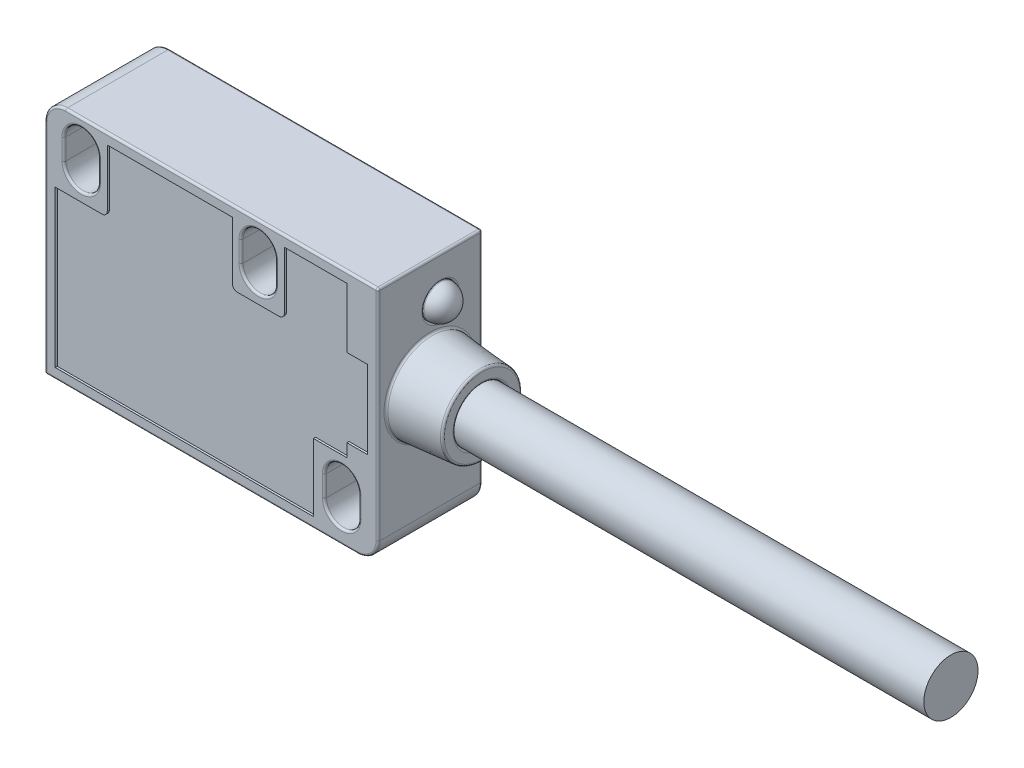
ISO-10303-21;
HEADER;
FILE_DESCRIPTION(('STEP AP214'),'2;1');
FILE_NAME('part.step','',(''),(''),'','','');
FILE_SCHEMA(('AUTOMOTIVE_DESIGN { 1 0 10303 214 1 1 1 1 }'));
ENDSEC;
DATA;
#1=APPLICATION_CONTEXT('core data for automotive mechanical design processes');
#2=APPLICATION_PROTOCOL_DEFINITION('international standard','automotive_design',2000,#1);
#3=PRODUCT_CONTEXT('',#1,'mechanical');
#4=PRODUCT('Part','Part','',(#3));
#5=PRODUCT_RELATED_PRODUCT_CATEGORY('part','',(#4));
#6=PRODUCT_DEFINITION_FORMATION('','',#4);
#7=PRODUCT_DEFINITION_CONTEXT('part definition',#1,'design');
#8=PRODUCT_DEFINITION('design','',#6,#7);
#9=PRODUCT_DEFINITION_SHAPE('','',#8);
#10=(LENGTH_UNIT() NAMED_UNIT(*) SI_UNIT(.MILLI.,.METRE.));
#11=(NAMED_UNIT(*) PLANE_ANGLE_UNIT() SI_UNIT($,.RADIAN.));
#12=(NAMED_UNIT(*) SI_UNIT($,.STERADIAN.) SOLID_ANGLE_UNIT());
#13=UNCERTAINTY_MEASURE_WITH_UNIT(LENGTH_MEASURE(1.E-05),#10,'distance_accuracy_value','');
#14=(GEOMETRIC_REPRESENTATION_CONTEXT(3) GLOBAL_UNCERTAINTY_ASSIGNED_CONTEXT((#13)) GLOBAL_UNIT_ASSIGNED_CONTEXT((#10,
#11,#12)) REPRESENTATION_CONTEXT('',''));
#15=CARTESIAN_POINT('',(0.,0.,0.));
#16=DIRECTION('',(0.,0.,1.));
#17=DIRECTION('',(1.,0.,0.));
#18=AXIS2_PLACEMENT_3D('',#15,#16,#17);
#19=CARTESIAN_POINT('',(-12.0939252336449,15.08125,10.));
#20=DIRECTION('',(-1.,0.,0.));
#21=DIRECTION('',(0.,-1.,0.));
#22=AXIS2_PLACEMENT_3D('',#19,#20,#21);
#23=PLANE('',#22);
#24=CARTESIAN_POINT('',(-12.0939252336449,4.58124999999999,5.));
#25=DIRECTION('',(-1.,0.,0.));
#26=DIRECTION('',(0.,-1.,0.));
#27=AXIS2_PLACEMENT_3D('',#24,#25,#26);
#28=CIRCLE('',#27,4.43326623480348);
#29=CARTESIAN_POINT('',(-12.0939252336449,0.147983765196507,5.));
#30=VERTEX_POINT('',#29);
#31=EDGE_CURVE('E970',#30,#30,#28,.T.);
#32=ORIENTED_EDGE('',*,*,#31,.T.);
#33=EDGE_LOOP('',(#32));
#34=FACE_BOUND('',#33,.T.);
#35=CARTESIAN_POINT('',(-12.0939252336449,11.08125,4.));
#36=DIRECTION('',(-1.,0.,0.));
#37=DIRECTION('',(0.,-1.,0.));
#38=AXIS2_PLACEMENT_3D('',#35,#36,#37);
#39=CIRCLE('',#38,1.8);
#40=CARTESIAN_POINT('',(-12.0939252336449,9.28124999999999,4.));
#41=VERTEX_POINT('',#40);
#42=EDGE_CURVE('E967',#41,#41,#39,.T.);
#43=ORIENTED_EDGE('',*,*,#42,.T.);
#44=EDGE_LOOP('',(#43));
#45=FACE_BOUND('',#44,.T.);
#46=DIRECTION('',(0.,1.,0.));
#47=VECTOR('',#46,1.);
#48=CARTESIAN_POINT('',(-12.0939252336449,-7.91875000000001,9.8));
#49=LINE('',#48,#47);
#50=CARTESIAN_POINT('',(-12.0939252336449,14.88125,9.8));
#51=VERTEX_POINT('',#50);
#52=CARTESIAN_POINT('',(-12.0939252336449,-5.91875000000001,9.8));
#53=VERTEX_POINT('',#52);
#54=EDGE_CURVE('E674',#51,#53,#49,.F.);
#55=ORIENTED_EDGE('',*,*,#54,.T.);
#56=DIRECTION('',(0.,0.,-1.));
#57=VECTOR('',#56,1.);
#58=CARTESIAN_POINT('',(-12.0939252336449,-5.91875000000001,10.));
#59=LINE('',#58,#57);
#60=CARTESIAN_POINT('',(-12.0939252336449,-5.91875000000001,0.200000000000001));
#61=VERTEX_POINT('',#60);
#62=EDGE_CURVE('E758',#53,#61,#59,.T.);
#63=ORIENTED_EDGE('',*,*,#62,.T.);
#64=DIRECTION('',(0.,1.,0.));
#65=VECTOR('',#64,1.);
#66=CARTESIAN_POINT('',(-12.0939252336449,15.08125,0.200000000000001));
#67=LINE('',#66,#65);
#68=CARTESIAN_POINT('',(-12.0939252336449,14.88125,0.200000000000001));
#69=VERTEX_POINT('',#68);
#70=EDGE_CURVE('E672',#61,#69,#67,.T.);
#71=ORIENTED_EDGE('',*,*,#70,.T.);
#72=DIRECTION('',(0.,0.,-1.));
#73=VECTOR('',#72,1.);
#74=CARTESIAN_POINT('',(-12.0939252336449,14.88125,10.));
#75=LINE('',#74,#73);
#76=EDGE_CURVE('E670',#69,#51,#75,.F.);
#77=ORIENTED_EDGE('',*,*,#76,.T.);
#78=EDGE_LOOP('',(#55,#63,#71,#77));
#79=FACE_BOUND('',#78,.T.);
#80=ADVANCED_FACE('F39',(#34,#45,#79),#23,.F.);
#81=CARTESIAN_POINT('',(-44.0939252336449,-7.91875000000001,10.));
#82=DIRECTION('',(0.,0.,1.));
#83=DIRECTION('',(1.,0.,0.));
#84=AXIS2_PLACEMENT_3D('',#81,#82,#83);
#85=PLANE('',#84);
#86=DIRECTION('',(-1.,0.,0.));
#87=VECTOR('',#86,1.);
#88=CARTESIAN_POINT('',(-21.0939252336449,8.08124999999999,10.));
#89=LINE('',#88,#87);
#90=CARTESIAN_POINT('',(-21.5939252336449,8.08124999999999,10.));
#91=VERTEX_POINT('',#90);
#92=CARTESIAN_POINT('',(-25.5939252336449,8.08124999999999,10.));
#93=VERTEX_POINT('',#92);
#94=EDGE_CURVE('E455',#91,#93,#89,.T.);
#95=ORIENTED_EDGE('',*,*,#94,.F.);
#96=CARTESIAN_POINT('',(-21.5939252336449,8.58124999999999,10.));
#97=DIRECTION('',(0.,0.,1.));
#98=DIRECTION('',(1.,0.,0.));
#99=AXIS2_PLACEMENT_3D('',#96,#97,#98);
#100=CIRCLE('',#99,0.5);
#101=CARTESIAN_POINT('',(-21.0939252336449,8.58124999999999,10.));
#102=VERTEX_POINT('',#101);
#103=EDGE_CURVE('E991',#91,#102,#100,.T.);
#104=ORIENTED_EDGE('',*,*,#103,.T.);
#105=DIRECTION('',(0.,-1.,0.));
#106=VECTOR('',#105,1.);
#107=CARTESIAN_POINT('',(-21.0939252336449,14.08125,10.));
#108=LINE('',#107,#106);
#109=CARTESIAN_POINT('',(-21.0939252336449,14.08125,10.));
#110=VERTEX_POINT('',#109);
#111=EDGE_CURVE('E533',#110,#102,#108,.T.);
#112=ORIENTED_EDGE('',*,*,#111,.F.);
#113=DIRECTION('',(-1.,0.,0.));
#114=VECTOR('',#113,1.);
#115=CARTESIAN_POINT('',(-15.0939252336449,14.08125,10.));
#116=LINE('',#115,#114);
#117=CARTESIAN_POINT('',(-15.0939252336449,14.08125,10.));
#118=VERTEX_POINT('',#117);
#119=EDGE_CURVE('E530',#118,#110,#116,.T.);
#120=ORIENTED_EDGE('',*,*,#119,.F.);
#121=DIRECTION('',(0.,1.,0.));
#122=VECTOR('',#121,1.);
#123=CARTESIAN_POINT('',(-15.0939252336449,14.08125,10.));
#124=LINE('',#123,#122);
#125=CARTESIAN_POINT('',(-15.0939252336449,8.33125,10.));
#126=VERTEX_POINT('',#125);
#127=EDGE_CURVE('E527',#126,#118,#124,.T.);
#128=ORIENTED_EDGE('',*,*,#127,.F.);
#129=DIRECTION('',(-1.,0.,0.));
#130=VECTOR('',#129,1.);
#131=CARTESIAN_POINT('',(-15.0939252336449,8.33125,10.));
#132=LINE('',#131,#130);
#133=CARTESIAN_POINT('',(-13.0939252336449,8.33125,10.));
#134=VERTEX_POINT('',#133);
#135=EDGE_CURVE('E524',#134,#126,#132,.T.);
#136=ORIENTED_EDGE('',*,*,#135,.F.);
#137=DIRECTION('',(0.,1.,0.));
#138=VECTOR('',#137,1.);
#139=CARTESIAN_POINT('',(-13.0939252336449,8.33125,10.));
#140=LINE('',#139,#138);
#141=CARTESIAN_POINT('',(-13.0939252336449,0.83125,10.));
#142=VERTEX_POINT('',#141);
#143=EDGE_CURVE('E521',#142,#134,#140,.T.);
#144=ORIENTED_EDGE('',*,*,#143,.F.);
#145=DIRECTION('',(1.,0.,0.));
#146=VECTOR('',#145,1.);
#147=CARTESIAN_POINT('',(-13.0939252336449,0.83125,10.));
#148=LINE('',#147,#146);
#149=CARTESIAN_POINT('',(-15.0939252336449,0.83125,10.));
#150=VERTEX_POINT('',#149);
#151=EDGE_CURVE('E518',#150,#142,#148,.T.);
#152=ORIENTED_EDGE('',*,*,#151,.F.);
#153=DIRECTION('',(0.,1.,0.));
#154=VECTOR('',#153,1.);
#155=CARTESIAN_POINT('',(-15.0939252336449,0.83125,10.));
#156=LINE('',#155,#154);
#157=CARTESIAN_POINT('',(-15.0939252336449,-0.418750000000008,10.));
#158=VERTEX_POINT('',#157);
#159=EDGE_CURVE('E515',#158,#150,#156,.T.);
#160=ORIENTED_EDGE('',*,*,#159,.F.);
#161=DIRECTION('',(1.,0.,0.));
#162=VECTOR('',#161,1.);
#163=CARTESIAN_POINT('',(-18.2939252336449,-0.418750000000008,10.));
#164=LINE('',#163,#162);
#165=CARTESIAN_POINT('',(-18.2939252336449,-0.418750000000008,10.));
#166=VERTEX_POINT('',#165);
#167=EDGE_CURVE('E512',#166,#158,#164,.T.);
#168=ORIENTED_EDGE('',*,*,#167,.F.);
#169=DIRECTION('',(0.,1.,0.));
#170=VECTOR('',#169,1.);
#171=CARTESIAN_POINT('',(-18.2939252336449,-6.91875000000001,10.));
#172=LINE('',#171,#170);
#173=CARTESIAN_POINT('',(-18.2939252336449,-6.91875000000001,10.));
#174=VERTEX_POINT('',#173);
#175=EDGE_CURVE('E509',#174,#166,#172,.T.);
#176=ORIENTED_EDGE('',*,*,#175,.F.);
#177=DIRECTION('',(1.,0.,0.));
#178=VECTOR('',#177,1.);
#179=CARTESIAN_POINT('',(-43.0939252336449,-6.91875000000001,10.));
#180=LINE('',#179,#178);
#181=CARTESIAN_POINT('',(-43.0939252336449,-6.91875000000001,10.));
#182=VERTEX_POINT('',#181);
#183=EDGE_CURVE('E506',#182,#174,#180,.T.);
#184=ORIENTED_EDGE('',*,*,#183,.F.);
#185=DIRECTION('',(0.,-1.,0.));
#186=VECTOR('',#185,1.);
#187=CARTESIAN_POINT('',(-43.0939252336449,8.08124999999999,10.));
#188=LINE('',#187,#186);
#189=CARTESIAN_POINT('',(-43.0939252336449,8.08124999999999,10.));
#190=VERTEX_POINT('',#189);
#191=EDGE_CURVE('E503',#190,#182,#188,.T.);
#192=ORIENTED_EDGE('',*,*,#191,.F.);
#193=DIRECTION('',(-1.,0.,0.));
#194=VECTOR('',#193,1.);
#195=CARTESIAN_POINT('',(-38.0939252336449,8.08124999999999,10.));
#196=LINE('',#195,#194);
#197=CARTESIAN_POINT('',(-38.5939252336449,8.08124999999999,10.));
#198=VERTEX_POINT('',#197);
#199=EDGE_CURVE('E501',#198,#190,#196,.T.);
#200=ORIENTED_EDGE('',*,*,#199,.F.);
#201=CARTESIAN_POINT('',(-38.5939252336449,8.58124999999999,10.));
#202=DIRECTION('',(0.,0.,1.));
#203=DIRECTION('',(1.,0.,0.));
#204=AXIS2_PLACEMENT_3D('',#201,#202,#203);
#205=CIRCLE('',#204,0.5);
#206=CARTESIAN_POINT('',(-38.0939252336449,8.58124999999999,10.));
#207=VERTEX_POINT('',#206);
#208=EDGE_CURVE('E987',#198,#207,#205,.T.);
#209=ORIENTED_EDGE('',*,*,#208,.T.);
#210=DIRECTION('',(0.,-1.,0.));
#211=VECTOR('',#210,1.);
#212=CARTESIAN_POINT('',(-38.0939252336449,14.08125,10.));
#213=LINE('',#212,#211);
#214=CARTESIAN_POINT('',(-38.0939252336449,14.08125,10.));
#215=VERTEX_POINT('',#214);
#216=EDGE_CURVE('E499',#215,#207,#213,.T.);
#217=ORIENTED_EDGE('',*,*,#216,.F.);
#218=DIRECTION('',(-1.,0.,0.));
#219=VECTOR('',#218,1.);
#220=CARTESIAN_POINT('',(-26.0939252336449,14.08125,10.));
#221=LINE('',#220,#219);
#222=CARTESIAN_POINT('',(-26.0939252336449,14.08125,10.));
#223=VERTEX_POINT('',#222);
#224=EDGE_CURVE('E441',#223,#215,#221,.T.);
#225=ORIENTED_EDGE('',*,*,#224,.F.);
#226=DIRECTION('',(0.,1.,0.));
#227=VECTOR('',#226,1.);
#228=CARTESIAN_POINT('',(-26.0939252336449,8.08124999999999,10.));
#229=LINE('',#228,#227);
#230=CARTESIAN_POINT('',(-26.0939252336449,8.58124999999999,10.));
#231=VERTEX_POINT('',#230);
#232=EDGE_CURVE('E453',#231,#223,#229,.T.);
#233=ORIENTED_EDGE('',*,*,#232,.F.);
#234=CARTESIAN_POINT('',(-25.5939252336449,8.58124999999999,10.));
#235=DIRECTION('',(0.,0.,1.));
#236=DIRECTION('',(1.,0.,0.));
#237=AXIS2_PLACEMENT_3D('',#234,#235,#236);
#238=CIRCLE('',#237,0.5);
#239=EDGE_CURVE('E989',#231,#93,#238,.T.);
#240=ORIENTED_EDGE('',*,*,#239,.T.);
#241=EDGE_LOOP('',(#95,#104,#112,#120,#128,#136,#144,#152,#160,#168,#176,#184,#192,#200,#209,
#217,#225,#233,#240));
#242=FACE_BOUND('',#241,.T.);
#243=CARTESIAN_POINT('',(-15.5939252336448,-4.91875000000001,10.));
#244=DIRECTION('',(0.,0.,1.));
#245=DIRECTION('',(1.,0.,0.));
#246=AXIS2_PLACEMENT_3D('',#243,#244,#245);
#247=CIRCLE('',#246,1.85);
#248=CARTESIAN_POINT('',(-13.7439252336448,-4.91875000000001,10.));
#249=VERTEX_POINT('',#248);
#250=CARTESIAN_POINT('',(-17.4439252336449,-4.91875000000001,10.));
#251=VERTEX_POINT('',#250);
#252=EDGE_CURVE('E883',#249,#251,#247,.F.);
#253=ORIENTED_EDGE('',*,*,#252,.T.);
#254=DIRECTION('',(0.,1.,0.));
#255=VECTOR('',#254,1.);
#256=CARTESIAN_POINT('',(-17.4439252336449,-2.91875000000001,10.));
#257=LINE('',#256,#255);
#258=CARTESIAN_POINT('',(-17.4439252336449,-2.91875000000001,10.));
#259=VERTEX_POINT('',#258);
#260=EDGE_CURVE('E885',#251,#259,#257,.T.);
#261=ORIENTED_EDGE('',*,*,#260,.T.);
#262=CARTESIAN_POINT('',(-15.5939252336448,-2.91875000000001,10.));
#263=DIRECTION('',(0.,0.,1.));
#264=DIRECTION('',(1.,0.,0.));
#265=AXIS2_PLACEMENT_3D('',#262,#263,#264);
#266=CIRCLE('',#265,1.85);
#267=CARTESIAN_POINT('',(-13.7439252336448,-2.91875000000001,10.));
#268=VERTEX_POINT('',#267);
#269=EDGE_CURVE('E879',#259,#268,#266,.F.);
#270=ORIENTED_EDGE('',*,*,#269,.T.);
#271=DIRECTION('',(0.,-1.,0.));
#272=VECTOR('',#271,1.);
#273=CARTESIAN_POINT('',(-13.7439252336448,-4.91875000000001,10.));
#274=LINE('',#273,#272);
#275=EDGE_CURVE('E881',#268,#249,#274,.T.);
#276=ORIENTED_EDGE('',*,*,#275,.T.);
#277=EDGE_LOOP('',(#253,#261,#270,#276));
#278=FACE_BOUND('',#277,.T.);
#279=CARTESIAN_POINT('',(-23.5939252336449,10.58125,10.));
#280=DIRECTION('',(0.,0.,1.));
#281=DIRECTION('',(1.,0.,0.));
#282=AXIS2_PLACEMENT_3D('',#279,#280,#281);
#283=CIRCLE('',#282,1.85);
#284=CARTESIAN_POINT('',(-21.7439252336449,10.58125,10.));
#285=VERTEX_POINT('',#284);
#286=CARTESIAN_POINT('',(-25.4439252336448,10.58125,10.));
#287=VERTEX_POINT('',#286);
#288=EDGE_CURVE('E874',#285,#287,#283,.F.);
#289=ORIENTED_EDGE('',*,*,#288,.T.);
#290=DIRECTION('',(0.,1.,0.));
#291=VECTOR('',#290,1.);
#292=CARTESIAN_POINT('',(-25.4439252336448,12.58125,10.));
#293=LINE('',#292,#291);
#294=CARTESIAN_POINT('',(-25.4439252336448,12.58125,10.));
#295=VERTEX_POINT('',#294);
#296=EDGE_CURVE('E876',#287,#295,#293,.T.);
#297=ORIENTED_EDGE('',*,*,#296,.T.);
#298=CARTESIAN_POINT('',(-23.5939252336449,12.58125,10.));
#299=DIRECTION('',(0.,0.,1.));
#300=DIRECTION('',(1.,0.,0.));
#301=AXIS2_PLACEMENT_3D('',#298,#299,#300);
#302=CIRCLE('',#301,1.85);
#303=CARTESIAN_POINT('',(-21.7439252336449,12.58125,10.));
#304=VERTEX_POINT('',#303);
#305=EDGE_CURVE('E870',#295,#304,#302,.F.);
#306=ORIENTED_EDGE('',*,*,#305,.T.);
#307=DIRECTION('',(0.,-1.,0.));
#308=VECTOR('',#307,1.);
#309=CARTESIAN_POINT('',(-21.7439252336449,10.58125,10.));
#310=LINE('',#309,#308);
#311=EDGE_CURVE('E872',#304,#285,#310,.T.);
#312=ORIENTED_EDGE('',*,*,#311,.T.);
#313=EDGE_LOOP('',(#289,#297,#306,#312));
#314=FACE_BOUND('',#313,.T.);
#315=CARTESIAN_POINT('',(-40.5939252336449,10.58125,10.));
#316=DIRECTION('',(0.,0.,1.));
#317=DIRECTION('',(1.,0.,0.));
#318=AXIS2_PLACEMENT_3D('',#315,#316,#317);
#319=CIRCLE('',#318,1.85);
#320=CARTESIAN_POINT('',(-38.7439252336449,10.58125,10.));
#321=VERTEX_POINT('',#320);
#322=CARTESIAN_POINT('',(-42.4439252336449,10.58125,10.));
#323=VERTEX_POINT('',#322);
#324=EDGE_CURVE('E865',#321,#323,#319,.F.);
#325=ORIENTED_EDGE('',*,*,#324,.T.);
#326=DIRECTION('',(0.,1.,0.));
#327=VECTOR('',#326,1.);
#328=CARTESIAN_POINT('',(-42.4439252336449,12.58125,10.));
#329=LINE('',#328,#327);
#330=CARTESIAN_POINT('',(-42.4439252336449,12.58125,10.));
#331=VERTEX_POINT('',#330);
#332=EDGE_CURVE('E867',#323,#331,#329,.T.);
#333=ORIENTED_EDGE('',*,*,#332,.T.);
#334=CARTESIAN_POINT('',(-40.5939252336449,12.58125,10.));
#335=DIRECTION('',(0.,0.,1.));
#336=DIRECTION('',(1.,0.,0.));
#337=AXIS2_PLACEMENT_3D('',#334,#335,#336);
#338=CIRCLE('',#337,1.85);
#339=CARTESIAN_POINT('',(-38.7439252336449,12.58125,10.));
#340=VERTEX_POINT('',#339);
#341=EDGE_CURVE('E861',#331,#340,#338,.F.);
#342=ORIENTED_EDGE('',*,*,#341,.T.);
#343=DIRECTION('',(0.,-1.,0.));
#344=VECTOR('',#343,1.);
#345=CARTESIAN_POINT('',(-38.7439252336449,10.58125,10.));
#346=LINE('',#345,#344);
#347=EDGE_CURVE('E863',#340,#321,#346,.T.);
#348=ORIENTED_EDGE('',*,*,#347,.T.);
#349=EDGE_LOOP('',(#325,#333,#342,#348));
#350=FACE_BOUND('',#349,.T.);
#351=CARTESIAN_POINT('',(-42.0939252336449,13.08125,10.));
#352=DIRECTION('',(0.,0.,1.));
#353=DIRECTION('',(1.,0.,0.));
#354=AXIS2_PLACEMENT_3D('',#351,#352,#353);
#355=CIRCLE('',#354,1.8);
#356=CARTESIAN_POINT('',(-43.8939252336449,13.08125,10.));
#357=VERTEX_POINT('',#356);
#358=CARTESIAN_POINT('',(-42.0939252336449,14.88125,10.));
#359=VERTEX_POINT('',#358);
#360=EDGE_CURVE('E773',#357,#359,#355,.F.);
#361=ORIENTED_EDGE('',*,*,#360,.F.);
#362=DIRECTION('',(0.,-1.,0.));
#363=VECTOR('',#362,1.);
#364=CARTESIAN_POINT('',(-43.8939252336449,-7.91875000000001,10.));
#365=LINE('',#364,#363);
#366=CARTESIAN_POINT('',(-43.8939252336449,-7.71875000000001,10.));
#367=VERTEX_POINT('',#366);
#368=EDGE_CURVE('E663',#357,#367,#365,.T.);
#369=ORIENTED_EDGE('',*,*,#368,.T.);
#370=DIRECTION('',(1.,0.,0.));
#371=VECTOR('',#370,1.);
#372=CARTESIAN_POINT('',(-12.0939252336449,-7.71875000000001,10.));
#373=LINE('',#372,#371);
#374=CARTESIAN_POINT('',(-14.0939252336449,-7.71875000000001,10.));
#375=VERTEX_POINT('',#374);
#376=EDGE_CURVE('E665',#367,#375,#373,.T.);
#377=ORIENTED_EDGE('',*,*,#376,.T.);
#378=CARTESIAN_POINT('',(-14.0939252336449,-5.91875000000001,10.));
#379=DIRECTION('',(0.,0.,1.));
#380=DIRECTION('',(1.,0.,0.));
#381=AXIS2_PLACEMENT_3D('',#378,#379,#380);
#382=CIRCLE('',#381,1.8);
#383=CARTESIAN_POINT('',(-12.2939252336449,-5.91875000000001,10.));
#384=VERTEX_POINT('',#383);
#385=EDGE_CURVE('E751',#384,#375,#382,.F.);
#386=ORIENTED_EDGE('',*,*,#385,.F.);
#387=DIRECTION('',(0.,1.,0.));
#388=VECTOR('',#387,1.);
#389=CARTESIAN_POINT('',(-12.2939252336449,15.08125,10.));
#390=LINE('',#389,#388);
#391=CARTESIAN_POINT('',(-12.2939252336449,14.88125,10.));
#392=VERTEX_POINT('',#391);
#393=EDGE_CURVE('E668',#384,#392,#390,.T.);
#394=ORIENTED_EDGE('',*,*,#393,.T.);
#395=DIRECTION('',(-1.,0.,0.));
#396=VECTOR('',#395,1.);
#397=CARTESIAN_POINT('',(-44.0939252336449,14.88125,10.));
#398=LINE('',#397,#396);
#399=EDGE_CURVE('E652',#392,#359,#398,.T.);
#400=ORIENTED_EDGE('',*,*,#399,.T.);
#401=EDGE_LOOP('',(#361,#369,#377,#386,#394,#400));
#402=FACE_BOUND('',#401,.T.);
#403=ADVANCED_FACE('F1015',(#242,#278,#314,#350,#402),#85,.T.);
#404=CARTESIAN_POINT('',(-44.0939252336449,-7.91875000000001,0.));
#405=DIRECTION('',(0.,0.,1.));
#406=DIRECTION('',(1.,0.,0.));
#407=AXIS2_PLACEMENT_3D('',#404,#405,#406);
#408=PLANE('',#407);
#409=CARTESIAN_POINT('',(-34.5939252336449,-5.91875000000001,0.));
#410=DIRECTION('',(0.,0.,-1.));
#411=DIRECTION('',(-1.,0.,0.));
#412=AXIS2_PLACEMENT_3D('',#409,#410,#411);
#413=CIRCLE('',#412,0.749999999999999);
#414=CARTESIAN_POINT('',(-35.3439252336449,-5.91875000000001,0.));
#415=VERTEX_POINT('',#414);
#416=EDGE_CURVE('E588',#415,#415,#413,.T.);
#417=ORIENTED_EDGE('',*,*,#416,.F.);
#418=EDGE_LOOP('',(#417));
#419=FACE_BOUND('',#418,.T.);
#420=DIRECTION('',(1.,0.,0.));
#421=VECTOR('',#420,1.);
#422=CARTESIAN_POINT('',(-24.4939252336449,-4.67951951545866,0.));
#423=LINE('',#422,#421);
#424=CARTESIAN_POINT('',(-25.6939252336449,-4.67951951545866,0.));
#425=VERTEX_POINT('',#424);
#426=CARTESIAN_POINT('',(-24.4939252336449,-4.67951951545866,0.));
#427=VERTEX_POINT('',#426);
#428=EDGE_CURVE('E611',#425,#427,#423,.T.);
#429=ORIENTED_EDGE('',*,*,#428,.F.);
#430=DIRECTION('',(-0.258819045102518,0.965925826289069,0.));
#431=VECTOR('',#430,1.);
#432=CARTESIAN_POINT('',(-25.6939252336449,-4.67951951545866,0.));
#433=LINE('',#432,#431);
#434=CARTESIAN_POINT('',(-25.0939252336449,-6.91875000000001,0.));
#435=VERTEX_POINT('',#434);
#436=EDGE_CURVE('E596',#435,#425,#433,.T.);
#437=ORIENTED_EDGE('',*,*,#436,.F.);
#438=DIRECTION('',(-0.258819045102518,-0.965925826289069,0.));
#439=VECTOR('',#438,1.);
#440=CARTESIAN_POINT('',(-25.0939252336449,-6.91875000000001,0.));
#441=LINE('',#440,#439);
#442=EDGE_CURVE('E603',#427,#435,#441,.T.);
#443=ORIENTED_EDGE('',*,*,#442,.F.);
#444=EDGE_LOOP('',(#429,#437,#443));
#445=FACE_BOUND('',#444,.T.);
#446=CARTESIAN_POINT('',(-40.5939252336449,12.58125,0.));
#447=DIRECTION('',(0.,0.,1.));
#448=DIRECTION('',(1.,0.,0.));
#449=AXIS2_PLACEMENT_3D('',#446,#447,#448);
#450=CIRCLE('',#449,1.85);
#451=CARTESIAN_POINT('',(-38.7439252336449,12.58125,0.));
#452=VERTEX_POINT('',#451);
#453=CARTESIAN_POINT('',(-42.4439252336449,12.58125,0.));
#454=VERTEX_POINT('',#453);
#455=EDGE_CURVE('E816',#452,#454,#450,.T.);
#456=ORIENTED_EDGE('',*,*,#455,.T.);
#457=DIRECTION('',(0.,1.,0.));
#458=VECTOR('',#457,1.);
#459=CARTESIAN_POINT('',(-42.4439252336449,-7.91875000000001,0.));
#460=LINE('',#459,#458);
#461=CARTESIAN_POINT('',(-42.4439252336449,10.58125,0.));
#462=VERTEX_POINT('',#461);
#463=EDGE_CURVE('E822',#454,#462,#460,.F.);
#464=ORIENTED_EDGE('',*,*,#463,.T.);
#465=CARTESIAN_POINT('',(-40.5939252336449,10.58125,0.));
#466=DIRECTION('',(0.,0.,1.));
#467=DIRECTION('',(1.,0.,0.));
#468=AXIS2_PLACEMENT_3D('',#465,#466,#467);
#469=CIRCLE('',#468,1.85);
#470=CARTESIAN_POINT('',(-38.7439252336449,10.58125,0.));
#471=VERTEX_POINT('',#470);
#472=EDGE_CURVE('E820',#462,#471,#469,.T.);
#473=ORIENTED_EDGE('',*,*,#472,.T.);
#474=DIRECTION('',(0.,-1.,0.));
#475=VECTOR('',#474,1.);
#476=CARTESIAN_POINT('',(-38.7439252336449,-7.91875000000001,0.));
#477=LINE('',#476,#475);
#478=EDGE_CURVE('E818',#471,#452,#477,.F.);
#479=ORIENTED_EDGE('',*,*,#478,.T.);
#480=EDGE_LOOP('',(#456,#464,#473,#479));
#481=FACE_BOUND('',#480,.T.);
#482=CARTESIAN_POINT('',(-23.5939252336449,12.58125,0.));
#483=DIRECTION('',(0.,0.,1.));
#484=DIRECTION('',(1.,0.,0.));
#485=AXIS2_PLACEMENT_3D('',#482,#483,#484);
#486=CIRCLE('',#485,1.85);
#487=CARTESIAN_POINT('',(-21.7439252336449,12.58125,0.));
#488=VERTEX_POINT('',#487);
#489=CARTESIAN_POINT('',(-25.4439252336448,12.58125,0.));
#490=VERTEX_POINT('',#489);
#491=EDGE_CURVE('E807',#488,#490,#486,.T.);
#492=ORIENTED_EDGE('',*,*,#491,.T.);
#493=DIRECTION('',(0.,1.,0.));
#494=VECTOR('',#493,1.);
#495=CARTESIAN_POINT('',(-25.4439252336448,-7.91875000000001,0.));
#496=LINE('',#495,#494);
#497=CARTESIAN_POINT('',(-25.4439252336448,10.58125,0.));
#498=VERTEX_POINT('',#497);
#499=EDGE_CURVE('E813',#490,#498,#496,.F.);
#500=ORIENTED_EDGE('',*,*,#499,.T.);
#501=CARTESIAN_POINT('',(-23.5939252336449,10.58125,0.));
#502=DIRECTION('',(0.,0.,1.));
#503=DIRECTION('',(1.,0.,0.));
#504=AXIS2_PLACEMENT_3D('',#501,#502,#503);
#505=CIRCLE('',#504,1.85);
#506=CARTESIAN_POINT('',(-21.7439252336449,10.58125,0.));
#507=VERTEX_POINT('',#506);
#508=EDGE_CURVE('E811',#498,#507,#505,.T.);
#509=ORIENTED_EDGE('',*,*,#508,.T.);
#510=DIRECTION('',(0.,-1.,0.));
#511=VECTOR('',#510,1.);
#512=CARTESIAN_POINT('',(-21.7439252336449,-7.91875000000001,0.));
#513=LINE('',#512,#511);
#514=EDGE_CURVE('E809',#507,#488,#513,.F.);
#515=ORIENTED_EDGE('',*,*,#514,.T.);
#516=EDGE_LOOP('',(#492,#500,#509,#515));
#517=FACE_BOUND('',#516,.T.);
#518=CARTESIAN_POINT('',(-15.5939252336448,-2.91875000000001,0.));
#519=DIRECTION('',(0.,0.,1.));
#520=DIRECTION('',(1.,0.,0.));
#521=AXIS2_PLACEMENT_3D('',#518,#519,#520);
#522=CIRCLE('',#521,1.85);
#523=CARTESIAN_POINT('',(-13.7439252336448,-2.91875000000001,0.));
#524=VERTEX_POINT('',#523);
#525=CARTESIAN_POINT('',(-17.4439252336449,-2.91875000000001,0.));
#526=VERTEX_POINT('',#525);
#527=EDGE_CURVE('E798',#524,#526,#522,.T.);
#528=ORIENTED_EDGE('',*,*,#527,.T.);
#529=DIRECTION('',(0.,1.,0.));
#530=VECTOR('',#529,1.);
#531=CARTESIAN_POINT('',(-17.4439252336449,-7.91875000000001,0.));
#532=LINE('',#531,#530);
#533=CARTESIAN_POINT('',(-17.4439252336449,-4.91875000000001,0.));
#534=VERTEX_POINT('',#533);
#535=EDGE_CURVE('E804',#526,#534,#532,.F.);
#536=ORIENTED_EDGE('',*,*,#535,.T.);
#537=CARTESIAN_POINT('',(-15.5939252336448,-4.91875000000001,0.));
#538=DIRECTION('',(0.,0.,1.));
#539=DIRECTION('',(1.,0.,0.));
#540=AXIS2_PLACEMENT_3D('',#537,#538,#539);
#541=CIRCLE('',#540,1.85);
#542=CARTESIAN_POINT('',(-13.7439252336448,-4.91875000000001,0.));
#543=VERTEX_POINT('',#542);
#544=EDGE_CURVE('E802',#534,#543,#541,.T.);
#545=ORIENTED_EDGE('',*,*,#544,.T.);
#546=DIRECTION('',(0.,-1.,0.));
#547=VECTOR('',#546,1.);
#548=CARTESIAN_POINT('',(-13.7439252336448,-7.91875000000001,0.));
#549=LINE('',#548,#547);
#550=EDGE_CURVE('E800',#543,#524,#549,.F.);
#551=ORIENTED_EDGE('',*,*,#550,.T.);
#552=EDGE_LOOP('',(#528,#536,#545,#551));
#553=FACE_BOUND('',#552,.T.);
#554=CARTESIAN_POINT('',(-42.0939252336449,13.08125,0.));
#555=DIRECTION('',(0.,0.,1.));
#556=DIRECTION('',(1.,0.,0.));
#557=AXIS2_PLACEMENT_3D('',#554,#555,#556);
#558=CIRCLE('',#557,1.8);
#559=CARTESIAN_POINT('',(-42.0939252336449,14.88125,0.));
#560=VERTEX_POINT('',#559);
#561=CARTESIAN_POINT('',(-43.8939252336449,13.08125,0.));
#562=VERTEX_POINT('',#561);
#563=EDGE_CURVE('E771',#560,#562,#558,.T.);
#564=ORIENTED_EDGE('',*,*,#563,.F.);
#565=DIRECTION('',(-1.,0.,0.));
#566=VECTOR('',#565,1.);
#567=CARTESIAN_POINT('',(-44.0939252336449,14.88125,0.));
#568=LINE('',#567,#566);
#569=CARTESIAN_POINT('',(-12.2939252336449,14.88125,0.));
#570=VERTEX_POINT('',#569);
#571=EDGE_CURVE('E689',#560,#570,#568,.F.);
#572=ORIENTED_EDGE('',*,*,#571,.T.);
#573=DIRECTION('',(0.,1.,0.));
#574=VECTOR('',#573,1.);
#575=CARTESIAN_POINT('',(-12.2939252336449,-7.91875,0.));
#576=LINE('',#575,#574);
#577=CARTESIAN_POINT('',(-12.2939252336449,-5.91875000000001,0.));
#578=VERTEX_POINT('',#577);
#579=EDGE_CURVE('E684',#570,#578,#576,.F.);
#580=ORIENTED_EDGE('',*,*,#579,.T.);
#581=CARTESIAN_POINT('',(-14.0939252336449,-5.91875000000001,0.));
#582=DIRECTION('',(0.,0.,1.));
#583=DIRECTION('',(1.,0.,0.));
#584=AXIS2_PLACEMENT_3D('',#581,#582,#583);
#585=CIRCLE('',#584,1.8);
#586=CARTESIAN_POINT('',(-14.0939252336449,-7.71875000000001,0.));
#587=VERTEX_POINT('',#586);
#588=EDGE_CURVE('E708',#587,#578,#585,.T.);
#589=ORIENTED_EDGE('',*,*,#588,.F.);
#590=DIRECTION('',(1.,0.,0.));
#591=VECTOR('',#590,1.);
#592=CARTESIAN_POINT('',(-44.0939252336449,-7.71875000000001,0.));
#593=LINE('',#592,#591);
#594=CARTESIAN_POINT('',(-43.8939252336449,-7.71875000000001,0.));
#595=VERTEX_POINT('',#594);
#596=EDGE_CURVE('E687',#587,#595,#593,.F.);
#597=ORIENTED_EDGE('',*,*,#596,.T.);
#598=DIRECTION('',(0.,-1.,0.));
#599=VECTOR('',#598,1.);
#600=CARTESIAN_POINT('',(-43.8939252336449,-7.91875000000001,0.));
#601=LINE('',#600,#599);
#602=EDGE_CURVE('E691',#595,#562,#601,.F.);
#603=ORIENTED_EDGE('',*,*,#602,.T.);
#604=EDGE_LOOP('',(#564,#572,#580,#589,#597,#603));
#605=FACE_BOUND('',#604,.T.);
#606=ADVANCED_FACE('F1090',(#419,#445,#481,#517,#553,#605),#408,.F.);
#607=CARTESIAN_POINT('',(-44.0939252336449,15.08125,10.));
#608=DIRECTION('',(1.,0.,0.));
#609=DIRECTION('',(0.,0.,-1.));
#610=AXIS2_PLACEMENT_3D('',#607,#608,#609);
#611=PLANE('',#610);
#612=CARTESIAN_POINT('',(-44.0939252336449,-5.91875000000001,3.));
#613=DIRECTION('',(-1.,0.,0.));
#614=DIRECTION('',(0.,0.,1.));
#615=AXIS2_PLACEMENT_3D('',#612,#613,#614);
#616=CIRCLE('',#615,0.749999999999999);
#617=CARTESIAN_POINT('',(-44.0939252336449,-5.91875000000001,3.75));
#618=VERTEX_POINT('',#617);
#619=EDGE_CURVE('E540',#618,#618,#616,.T.);
#620=ORIENTED_EDGE('',*,*,#619,.F.);
#621=EDGE_LOOP('',(#620));
#622=FACE_BOUND('',#621,.T.);
#623=DIRECTION('',(0.,0.965925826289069,0.258819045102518));
#624=VECTOR('',#623,1.);
#625=CARTESIAN_POINT('',(-44.0939252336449,-6.91875000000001,7.));
#626=LINE('',#625,#624);
#627=CARTESIAN_POINT('',(-44.0939252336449,-6.91875000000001,7.));
#628=VERTEX_POINT('',#627);
#629=CARTESIAN_POINT('',(-44.0939252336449,-4.67951951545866,7.6));
#630=VERTEX_POINT('',#629);
#631=EDGE_CURVE('E581',#628,#630,#626,.T.);
#632=ORIENTED_EDGE('',*,*,#631,.F.);
#633=DIRECTION('',(0.,-0.965925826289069,0.258819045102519));
#634=VECTOR('',#633,1.);
#635=CARTESIAN_POINT('',(-44.0939252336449,-4.67951951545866,6.4));
#636=LINE('',#635,#634);
#637=CARTESIAN_POINT('',(-44.0939252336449,-4.67951951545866,6.4));
#638=VERTEX_POINT('',#637);
#639=EDGE_CURVE('E566',#638,#628,#636,.T.);
#640=ORIENTED_EDGE('',*,*,#639,.F.);
#641=DIRECTION('',(0.,0.,-1.));
#642=VECTOR('',#641,1.);
#643=CARTESIAN_POINT('',(-44.0939252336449,-4.67951951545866,7.6));
#644=LINE('',#643,#642);
#645=EDGE_CURVE('E573',#630,#638,#644,.T.);
#646=ORIENTED_EDGE('',*,*,#645,.F.);
#647=EDGE_LOOP('',(#632,#640,#646));
#648=FACE_BOUND('',#647,.T.);
#649=DIRECTION('',(0.,-1.,0.));
#650=VECTOR('',#649,1.);
#651=CARTESIAN_POINT('',(-44.0939252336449,15.08125,9.8));
#652=LINE('',#651,#650);
#653=CARTESIAN_POINT('',(-44.0939252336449,-7.71875000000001,9.8));
#654=VERTEX_POINT('',#653);
#655=CARTESIAN_POINT('',(-44.0939252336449,13.08125,9.8));
#656=VERTEX_POINT('',#655);
#657=EDGE_CURVE('E679',#654,#656,#652,.F.);
#658=ORIENTED_EDGE('',*,*,#657,.T.);
#659=DIRECTION('',(0.,0.,-1.));
#660=VECTOR('',#659,1.);
#661=CARTESIAN_POINT('',(-44.0939252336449,13.08125,10.));
#662=LINE('',#661,#660);
#663=CARTESIAN_POINT('',(-44.0939252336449,13.08125,0.200000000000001));
#664=VERTEX_POINT('',#663);
#665=EDGE_CURVE('E782',#656,#664,#662,.T.);
#666=ORIENTED_EDGE('',*,*,#665,.T.);
#667=DIRECTION('',(0.,-1.,0.));
#668=VECTOR('',#667,1.);
#669=CARTESIAN_POINT('',(-44.0939252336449,15.08125,0.200000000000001));
#670=LINE('',#669,#668);
#671=CARTESIAN_POINT('',(-44.0939252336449,-7.71875000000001,0.200000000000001));
#672=VERTEX_POINT('',#671);
#673=EDGE_CURVE('E682',#664,#672,#670,.T.);
#674=ORIENTED_EDGE('',*,*,#673,.T.);
#675=DIRECTION('',(0.,0.,-1.));
#676=VECTOR('',#675,1.);
#677=CARTESIAN_POINT('',(-44.0939252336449,-7.71875000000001,10.));
#678=LINE('',#677,#676);
#679=EDGE_CURVE('E677',#672,#654,#678,.F.);
#680=ORIENTED_EDGE('',*,*,#679,.T.);
#681=EDGE_LOOP('',(#658,#666,#674,#680));
#682=FACE_BOUND('',#681,.T.);
#683=ADVANCED_FACE('F1100',(#622,#648,#682),#611,.F.);
#684=CARTESIAN_POINT('',(-44.0939252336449,-7.91875000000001,10.));
#685=DIRECTION('',(0.,1.,0.));
#686=DIRECTION('',(0.,0.,1.));
#687=AXIS2_PLACEMENT_3D('',#684,#685,#686);
#688=PLANE('',#687);
#689=DIRECTION('',(1.,0.,0.));
#690=VECTOR('',#689,1.);
#691=CARTESIAN_POINT('',(-44.0939252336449,-7.91875000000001,0.200000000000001));
#692=LINE('',#691,#690);
#693=CARTESIAN_POINT('',(-43.8939252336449,-7.91875000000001,0.200000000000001));
#694=VERTEX_POINT('',#693);
#695=CARTESIAN_POINT('',(-14.0939252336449,-7.91875000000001,0.200000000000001));
#696=VERTEX_POINT('',#695);
#697=EDGE_CURVE('E705',#694,#696,#692,.T.);
#698=ORIENTED_EDGE('',*,*,#697,.T.);
#699=DIRECTION('',(0.,0.,-1.));
#700=VECTOR('',#699,1.);
#701=CARTESIAN_POINT('',(-14.0939252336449,-7.91875000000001,10.));
#702=LINE('',#701,#700);
#703=CARTESIAN_POINT('',(-14.0939252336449,-7.91875000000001,9.8));
#704=VERTEX_POINT('',#703);
#705=EDGE_CURVE('E760',#696,#704,#702,.F.);
#706=ORIENTED_EDGE('',*,*,#705,.T.);
#707=DIRECTION('',(1.,0.,0.));
#708=VECTOR('',#707,1.);
#709=CARTESIAN_POINT('',(-44.0939252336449,-7.91875000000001,9.8));
#710=LINE('',#709,#708);
#711=CARTESIAN_POINT('',(-43.8939252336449,-7.91875000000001,9.8));
#712=VERTEX_POINT('',#711);
#713=EDGE_CURVE('E703',#704,#712,#710,.F.);
#714=ORIENTED_EDGE('',*,*,#713,.T.);
#715=DIRECTION('',(0.,0.,-1.));
#716=VECTOR('',#715,1.);
#717=CARTESIAN_POINT('',(-43.8939252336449,-7.91875000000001,10.));
#718=LINE('',#717,#716);
#719=EDGE_CURVE('E701',#712,#694,#718,.T.);
#720=ORIENTED_EDGE('',*,*,#719,.T.);
#721=EDGE_LOOP('',(#698,#706,#714,#720));
#722=FACE_BOUND('',#721,.T.);
#723=ADVANCED_FACE('F1097',(#722),#688,.F.);
#724=CARTESIAN_POINT('',(-44.0939252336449,15.08125,10.));
#725=DIRECTION('',(0.,-1.,0.));
#726=DIRECTION('',(0.,0.,-1.));
#727=AXIS2_PLACEMENT_3D('',#724,#725,#726);
#728=PLANE('',#727);
#729=DIRECTION('',(-1.,0.,0.));
#730=VECTOR('',#729,1.);
#731=CARTESIAN_POINT('',(-44.0939252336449,15.08125,0.200000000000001));
#732=LINE('',#731,#730);
#733=CARTESIAN_POINT('',(-12.2939252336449,15.08125,0.200000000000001));
#734=VERTEX_POINT('',#733);
#735=CARTESIAN_POINT('',(-42.0939252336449,15.08125,0.200000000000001));
#736=VERTEX_POINT('',#735);
#737=EDGE_CURVE('E698',#734,#736,#732,.T.);
#738=ORIENTED_EDGE('',*,*,#737,.T.);
#739=DIRECTION('',(0.,0.,-1.));
#740=VECTOR('',#739,1.);
#741=CARTESIAN_POINT('',(-42.0939252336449,15.08125,10.));
#742=LINE('',#741,#740);
#743=CARTESIAN_POINT('',(-42.0939252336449,15.08125,9.8));
#744=VERTEX_POINT('',#743);
#745=EDGE_CURVE('E784',#736,#744,#742,.F.);
#746=ORIENTED_EDGE('',*,*,#745,.T.);
#747=DIRECTION('',(-1.,0.,0.));
#748=VECTOR('',#747,1.);
#749=CARTESIAN_POINT('',(-12.0939252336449,15.08125,9.8));
#750=LINE('',#749,#748);
#751=CARTESIAN_POINT('',(-12.2939252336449,15.08125,9.8));
#752=VERTEX_POINT('',#751);
#753=EDGE_CURVE('E696',#744,#752,#750,.F.);
#754=ORIENTED_EDGE('',*,*,#753,.T.);
#755=DIRECTION('',(0.,0.,-1.));
#756=VECTOR('',#755,1.);
#757=CARTESIAN_POINT('',(-12.2939252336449,15.08125,10.));
#758=LINE('',#757,#756);
#759=EDGE_CURVE('E694',#752,#734,#758,.T.);
#760=ORIENTED_EDGE('',*,*,#759,.T.);
#761=EDGE_LOOP('',(#738,#746,#754,#760));
#762=FACE_BOUND('',#761,.T.);
#763=ADVANCED_FACE('F1095',(#762),#728,.F.);
#764=CARTESIAN_POINT('',(-23.5939252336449,10.58125,10.));
#765=DIRECTION('',(0.,0.,-1.));
#766=DIRECTION('',(-1.,0.,0.));
#767=AXIS2_PLACEMENT_3D('',#764,#765,#766);
#768=CYLINDRICAL_SURFACE('',#767,1.65);
#769=DIRECTION('',(0.,0.,-1.));
#770=VECTOR('',#769,1.);
#771=CARTESIAN_POINT('',(-21.9439252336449,10.58125,10.));
#772=LINE('',#771,#770);
#773=CARTESIAN_POINT('',(-21.9439252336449,10.58125,9.8));
#774=VERTEX_POINT('',#773);
#775=CARTESIAN_POINT('',(-21.9439252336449,10.58125,0.200000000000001));
#776=VERTEX_POINT('',#775);
#777=EDGE_CURVE('E649',#774,#776,#772,.T.);
#778=ORIENTED_EDGE('',*,*,#777,.T.);
#779=CARTESIAN_POINT('',(-23.5939252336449,10.58125,0.200000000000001));
#780=DIRECTION('',(0.,0.,1.));
#781=DIRECTION('',(1.,0.,0.));
#782=AXIS2_PLACEMENT_3D('',#779,#780,#781);
#783=CIRCLE('',#782,1.65);
#784=CARTESIAN_POINT('',(-25.2439252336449,10.58125,0.200000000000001));
#785=VERTEX_POINT('',#784);
#786=EDGE_CURVE('E841',#776,#785,#783,.F.);
#787=ORIENTED_EDGE('',*,*,#786,.T.);
#788=DIRECTION('',(0.,0.,-1.));
#789=VECTOR('',#788,1.);
#790=CARTESIAN_POINT('',(-25.2439252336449,10.58125,10.));
#791=LINE('',#790,#789);
#792=CARTESIAN_POINT('',(-25.2439252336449,10.58125,9.8));
#793=VERTEX_POINT('',#792);
#794=EDGE_CURVE('E640',#793,#785,#791,.T.);
#795=ORIENTED_EDGE('',*,*,#794,.F.);
#796=CARTESIAN_POINT('',(-23.5939252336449,10.58125,9.8));
#797=DIRECTION('',(0.,0.,1.));
#798=DIRECTION('',(1.,0.,0.));
#799=AXIS2_PLACEMENT_3D('',#796,#797,#798);
#800=CIRCLE('',#799,1.65);
#801=EDGE_CURVE('E839',#793,#774,#800,.T.);
#802=ORIENTED_EDGE('',*,*,#801,.T.);
#803=EDGE_LOOP('',(#778,#787,#795,#802));
#804=FACE_BOUND('',#803,.T.);
#805=ADVANCED_FACE('F1431',(#804),#768,.F.);
#806=CARTESIAN_POINT('',(-21.9439252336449,10.58125,10.));
#807=DIRECTION('',(1.,0.,0.));
#808=DIRECTION('',(0.,0.,-1.));
#809=AXIS2_PLACEMENT_3D('',#806,#807,#808);
#810=PLANE('',#809);
#811=DIRECTION('',(0.,0.,-1.));
#812=VECTOR('',#811,1.);
#813=CARTESIAN_POINT('',(-21.9439252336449,12.58125,10.));
#814=LINE('',#813,#812);
#815=CARTESIAN_POINT('',(-21.9439252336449,12.58125,9.8));
#816=VERTEX_POINT('',#815);
#817=CARTESIAN_POINT('',(-21.9439252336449,12.58125,0.200000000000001));
#818=VERTEX_POINT('',#817);
#819=EDGE_CURVE('E653',#816,#818,#814,.T.);
#820=ORIENTED_EDGE('',*,*,#819,.T.);
#821=DIRECTION('',(0.,-1.,0.));
#822=VECTOR('',#821,1.);
#823=CARTESIAN_POINT('',(-21.9439252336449,10.58125,0.200000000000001));
#824=LINE('',#823,#822);
#825=EDGE_CURVE('E845',#818,#776,#824,.T.);
#826=ORIENTED_EDGE('',*,*,#825,.T.);
#827=ORIENTED_EDGE('',*,*,#777,.F.);
#828=DIRECTION('',(0.,-1.,0.));
#829=VECTOR('',#828,1.);
#830=CARTESIAN_POINT('',(-21.9439252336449,12.58125,9.8));
#831=LINE('',#830,#829);
#832=EDGE_CURVE('E843',#774,#816,#831,.F.);
#833=ORIENTED_EDGE('',*,*,#832,.T.);
#834=EDGE_LOOP('',(#820,#826,#827,#833));
#835=FACE_BOUND('',#834,.T.);
#836=ADVANCED_FACE('F1427',(#835),#810,.F.);
#837=CARTESIAN_POINT('',(-23.5939252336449,12.58125,10.));
#838=DIRECTION('',(0.,0.,-1.));
#839=DIRECTION('',(-1.,0.,0.));
#840=AXIS2_PLACEMENT_3D('',#837,#838,#839);
#841=CYLINDRICAL_SURFACE('',#840,1.65);
#842=DIRECTION('',(0.,0.,-1.));
#843=VECTOR('',#842,1.);
#844=CARTESIAN_POINT('',(-25.2439252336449,12.58125,10.));
#845=LINE('',#844,#843);
#846=CARTESIAN_POINT('',(-25.2439252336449,12.58125,9.8));
#847=VERTEX_POINT('',#846);
#848=CARTESIAN_POINT('',(-25.2439252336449,12.58125,0.200000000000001));
#849=VERTEX_POINT('',#848);
#850=EDGE_CURVE('E656',#847,#849,#845,.T.);
#851=ORIENTED_EDGE('',*,*,#850,.T.);
#852=CARTESIAN_POINT('',(-23.5939252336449,12.58125,0.200000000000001));
#853=DIRECTION('',(0.,0.,1.));
#854=DIRECTION('',(1.,0.,0.));
#855=AXIS2_PLACEMENT_3D('',#852,#853,#854);
#856=CIRCLE('',#855,1.65);
#857=EDGE_CURVE('E894',#849,#818,#856,.F.);
#858=ORIENTED_EDGE('',*,*,#857,.T.);
#859=ORIENTED_EDGE('',*,*,#819,.F.);
#860=CARTESIAN_POINT('',(-23.5939252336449,12.58125,9.8));
#861=DIRECTION('',(0.,0.,1.));
#862=DIRECTION('',(1.,0.,0.));
#863=AXIS2_PLACEMENT_3D('',#860,#861,#862);
#864=CIRCLE('',#863,1.65);
#865=EDGE_CURVE('E892',#816,#847,#864,.T.);
#866=ORIENTED_EDGE('',*,*,#865,.T.);
#867=EDGE_LOOP('',(#851,#858,#859,#866));
#868=FACE_BOUND('',#867,.T.);
#869=ADVANCED_FACE('F1430',(#868),#841,.F.);
#870=CARTESIAN_POINT('',(-25.2439252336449,10.58125,10.));
#871=DIRECTION('',(-1.,0.,0.));
#872=DIRECTION('',(0.,0.,1.));
#873=AXIS2_PLACEMENT_3D('',#870,#871,#872);
#874=PLANE('',#873);
#875=ORIENTED_EDGE('',*,*,#794,.T.);
#876=DIRECTION('',(0.,1.,0.));
#877=VECTOR('',#876,1.);
#878=CARTESIAN_POINT('',(-25.2439252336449,10.58125,0.200000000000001));
#879=LINE('',#878,#877);
#880=EDGE_CURVE('E836',#785,#849,#879,.T.);
#881=ORIENTED_EDGE('',*,*,#880,.T.);
#882=ORIENTED_EDGE('',*,*,#850,.F.);
#883=DIRECTION('',(0.,1.,0.));
#884=VECTOR('',#883,1.);
#885=CARTESIAN_POINT('',(-25.2439252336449,10.58125,9.8));
#886=LINE('',#885,#884);
#887=EDGE_CURVE('E833',#847,#793,#886,.F.);
#888=ORIENTED_EDGE('',*,*,#887,.T.);
#889=EDGE_LOOP('',(#875,#881,#882,#888));
#890=FACE_BOUND('',#889,.T.);
#891=ADVANCED_FACE('F1425',(#890),#874,.F.);
#892=CARTESIAN_POINT('',(-40.5939252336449,10.58125,10.));
#893=DIRECTION('',(0.,0.,-1.));
#894=DIRECTION('',(-1.,0.,0.));
#895=AXIS2_PLACEMENT_3D('',#892,#893,#894);
#896=CYLINDRICAL_SURFACE('',#895,1.65);
#897=DIRECTION('',(0.,0.,-1.));
#898=VECTOR('',#897,1.);
#899=CARTESIAN_POINT('',(-38.9439252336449,10.58125,10.));
#900=LINE('',#899,#898);
#901=CARTESIAN_POINT('',(-38.9439252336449,10.58125,9.8));
#902=VERTEX_POINT('',#901);
#903=CARTESIAN_POINT('',(-38.9439252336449,10.58125,0.200000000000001));
#904=VERTEX_POINT('',#903);
#905=EDGE_CURVE('E637',#902,#904,#900,.T.);
#906=ORIENTED_EDGE('',*,*,#905,.T.);
#907=CARTESIAN_POINT('',(-40.5939252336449,10.58125,0.200000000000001));
#908=DIRECTION('',(0.,0.,1.));
#909=DIRECTION('',(1.,0.,0.));
#910=AXIS2_PLACEMENT_3D('',#907,#908,#909);
#911=CIRCLE('',#910,1.65);
#912=CARTESIAN_POINT('',(-42.2439252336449,10.58125,0.200000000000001));
#913=VERTEX_POINT('',#912);
#914=EDGE_CURVE('E827',#904,#913,#911,.F.);
#915=ORIENTED_EDGE('',*,*,#914,.T.);
#916=DIRECTION('',(0.,0.,-1.));
#917=VECTOR('',#916,1.);
#918=CARTESIAN_POINT('',(-42.2439252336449,10.58125,10.));
#919=LINE('',#918,#917);
#920=CARTESIAN_POINT('',(-42.2439252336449,10.58125,9.8));
#921=VERTEX_POINT('',#920);
#922=EDGE_CURVE('E626',#921,#913,#919,.T.);
#923=ORIENTED_EDGE('',*,*,#922,.F.);
#924=CARTESIAN_POINT('',(-40.5939252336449,10.58125,9.8));
#925=DIRECTION('',(0.,0.,1.));
#926=DIRECTION('',(1.,0.,0.));
#927=AXIS2_PLACEMENT_3D('',#924,#925,#926);
#928=CIRCLE('',#927,1.65);
#929=EDGE_CURVE('E825',#921,#902,#928,.T.);
#930=ORIENTED_EDGE('',*,*,#929,.T.);
#931=EDGE_LOOP('',(#906,#915,#923,#930));
#932=FACE_BOUND('',#931,.T.);
#933=ADVANCED_FACE('F1415',(#932),#896,.F.);
#934=CARTESIAN_POINT('',(-38.9439252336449,10.58125,10.));
#935=DIRECTION('',(1.,0.,0.));
#936=DIRECTION('',(0.,0.,-1.));
#937=AXIS2_PLACEMENT_3D('',#934,#935,#936);
#938=PLANE('',#937);
#939=DIRECTION('',(0.,0.,-1.));
#940=VECTOR('',#939,1.);
#941=CARTESIAN_POINT('',(-38.9439252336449,12.58125,10.));
#942=LINE('',#941,#940);
#943=CARTESIAN_POINT('',(-38.9439252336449,12.58125,9.8));
#944=VERTEX_POINT('',#943);
#945=CARTESIAN_POINT('',(-38.9439252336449,12.58125,0.200000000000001));
#946=VERTEX_POINT('',#945);
#947=EDGE_CURVE('E641',#944,#946,#942,.T.);
#948=ORIENTED_EDGE('',*,*,#947,.T.);
#949=DIRECTION('',(0.,-1.,0.));
#950=VECTOR('',#949,1.);
#951=CARTESIAN_POINT('',(-38.9439252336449,10.58125,0.200000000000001));
#952=LINE('',#951,#950);
#953=EDGE_CURVE('E831',#946,#904,#952,.T.);
#954=ORIENTED_EDGE('',*,*,#953,.T.);
#955=ORIENTED_EDGE('',*,*,#905,.F.);
#956=DIRECTION('',(0.,-1.,0.));
#957=VECTOR('',#956,1.);
#958=CARTESIAN_POINT('',(-38.9439252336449,12.58125,9.8));
#959=LINE('',#958,#957);
#960=EDGE_CURVE('E829',#902,#944,#959,.F.);
#961=ORIENTED_EDGE('',*,*,#960,.T.);
#962=EDGE_LOOP('',(#948,#954,#955,#961));
#963=FACE_BOUND('',#962,.T.);
#964=ADVANCED_FACE('F1411',(#963),#938,.F.);
#965=CARTESIAN_POINT('',(-40.5939252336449,12.58125,10.));
#966=DIRECTION('',(0.,0.,-1.));
#967=DIRECTION('',(-1.,0.,0.));
#968=AXIS2_PLACEMENT_3D('',#965,#966,#967);
#969=CYLINDRICAL_SURFACE('',#968,1.65);
#970=DIRECTION('',(0.,0.,-1.));
#971=VECTOR('',#970,1.);
#972=CARTESIAN_POINT('',(-42.2439252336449,12.58125,10.));
#973=LINE('',#972,#971);
#974=CARTESIAN_POINT('',(-42.2439252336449,12.58125,9.8));
#975=VERTEX_POINT('',#974);
#976=CARTESIAN_POINT('',(-42.2439252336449,12.58125,0.200000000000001));
#977=VERTEX_POINT('',#976);
#978=EDGE_CURVE('E644',#975,#977,#973,.T.);
#979=ORIENTED_EDGE('',*,*,#978,.T.);
#980=CARTESIAN_POINT('',(-40.5939252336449,12.58125,0.200000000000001));
#981=DIRECTION('',(0.,0.,1.));
#982=DIRECTION('',(1.,0.,0.));
#983=AXIS2_PLACEMENT_3D('',#980,#981,#982);
#984=CIRCLE('',#983,1.65);
#985=EDGE_CURVE('E890',#977,#946,#984,.F.);
#986=ORIENTED_EDGE('',*,*,#985,.T.);
#987=ORIENTED_EDGE('',*,*,#947,.F.);
#988=CARTESIAN_POINT('',(-40.5939252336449,12.58125,9.8));
#989=DIRECTION('',(0.,0.,1.));
#990=DIRECTION('',(1.,0.,0.));
#991=AXIS2_PLACEMENT_3D('',#988,#989,#990);
#992=CIRCLE('',#991,1.65);
#993=EDGE_CURVE('E888',#944,#975,#992,.T.);
#994=ORIENTED_EDGE('',*,*,#993,.T.);
#995=EDGE_LOOP('',(#979,#986,#987,#994));
#996=FACE_BOUND('',#995,.T.);
#997=ADVANCED_FACE('F1414',(#996),#969,.F.);
#998=CARTESIAN_POINT('',(-42.2439252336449,10.58125,10.));
#999=DIRECTION('',(-1.,0.,0.));
#1000=DIRECTION('',(0.,0.,1.));
#1001=AXIS2_PLACEMENT_3D('',#998,#999,#1000);
#1002=PLANE('',#1001);
#1003=ORIENTED_EDGE('',*,*,#922,.T.);
#1004=DIRECTION('',(0.,1.,0.));
#1005=VECTOR('',#1004,1.);
#1006=CARTESIAN_POINT('',(-42.2439252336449,10.58125,0.200000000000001));
#1007=LINE('',#1006,#1005);
#1008=EDGE_CURVE('E795',#913,#977,#1007,.T.);
#1009=ORIENTED_EDGE('',*,*,#1008,.T.);
#1010=ORIENTED_EDGE('',*,*,#978,.F.);
#1011=DIRECTION('',(0.,1.,0.));
#1012=VECTOR('',#1011,1.);
#1013=CARTESIAN_POINT('',(-42.2439252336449,10.58125,9.8));
#1014=LINE('',#1013,#1012);
#1015=EDGE_CURVE('E786',#975,#921,#1014,.F.);
#1016=ORIENTED_EDGE('',*,*,#1015,.T.);
#1017=EDGE_LOOP('',(#1003,#1009,#1010,#1016));
#1018=FACE_BOUND('',#1017,.T.);
#1019=ADVANCED_FACE('F1409',(#1018),#1002,.F.);
#1020=CARTESIAN_POINT('',(-15.5939252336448,-4.91875000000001,10.));
#1021=DIRECTION('',(0.,0.,-1.));
#1022=DIRECTION('',(-1.,0.,0.));
#1023=AXIS2_PLACEMENT_3D('',#1020,#1021,#1022);
#1024=CYLINDRICAL_SURFACE('',#1023,1.65);
#1025=DIRECTION('',(0.,0.,-1.));
#1026=VECTOR('',#1025,1.);
#1027=CARTESIAN_POINT('',(-13.9439252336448,-4.91875000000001,10.));
#1028=LINE('',#1027,#1026);
#1029=CARTESIAN_POINT('',(-13.9439252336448,-4.91875000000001,9.8));
#1030=VERTEX_POINT('',#1029);
#1031=CARTESIAN_POINT('',(-13.9439252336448,-4.91875000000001,0.200000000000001));
#1032=VERTEX_POINT('',#1031);
#1033=EDGE_CURVE('E623',#1030,#1032,#1028,.T.);
#1034=ORIENTED_EDGE('',*,*,#1033,.T.);
#1035=CARTESIAN_POINT('',(-15.5939252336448,-4.91875000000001,0.200000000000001));
#1036=DIRECTION('',(0.,0.,1.));
#1037=DIRECTION('',(1.,0.,0.));
#1038=AXIS2_PLACEMENT_3D('',#1035,#1036,#1037);
#1039=CIRCLE('',#1038,1.65);
#1040=CARTESIAN_POINT('',(-17.2439252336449,-4.91875000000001,0.200000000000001));
#1041=VERTEX_POINT('',#1040);
#1042=EDGE_CURVE('E855',#1032,#1041,#1039,.F.);
#1043=ORIENTED_EDGE('',*,*,#1042,.T.);
#1044=DIRECTION('',(0.,0.,-1.));
#1045=VECTOR('',#1044,1.);
#1046=CARTESIAN_POINT('',(-17.2439252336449,-4.91875000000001,10.));
#1047=LINE('',#1046,#1045);
#1048=CARTESIAN_POINT('',(-17.2439252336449,-4.91875000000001,9.8));
#1049=VERTEX_POINT('',#1048);
#1050=EDGE_CURVE('E633',#1049,#1041,#1047,.T.);
#1051=ORIENTED_EDGE('',*,*,#1050,.F.);
#1052=CARTESIAN_POINT('',(-15.5939252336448,-4.91875000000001,9.8));
#1053=DIRECTION('',(0.,0.,1.));
#1054=DIRECTION('',(1.,0.,0.));
#1055=AXIS2_PLACEMENT_3D('',#1052,#1053,#1054);
#1056=CIRCLE('',#1055,1.65);
#1057=EDGE_CURVE('E853',#1049,#1030,#1056,.T.);
#1058=ORIENTED_EDGE('',*,*,#1057,.T.);
#1059=EDGE_LOOP('',(#1034,#1043,#1051,#1058));
#1060=FACE_BOUND('',#1059,.T.);
#1061=ADVANCED_FACE('F1399',(#1060),#1024,.F.);
#1062=CARTESIAN_POINT('',(-13.9439252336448,-4.91875000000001,10.));
#1063=DIRECTION('',(1.,0.,0.));
#1064=DIRECTION('',(0.,0.,-1.));
#1065=AXIS2_PLACEMENT_3D('',#1062,#1063,#1064);
#1066=PLANE('',#1065);
#1067=DIRECTION('',(0.,0.,-1.));
#1068=VECTOR('',#1067,1.);
#1069=CARTESIAN_POINT('',(-13.9439252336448,-2.91875000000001,10.));
#1070=LINE('',#1069,#1068);
#1071=CARTESIAN_POINT('',(-13.9439252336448,-2.91875000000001,9.8));
#1072=VERTEX_POINT('',#1071);
#1073=CARTESIAN_POINT('',(-13.9439252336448,-2.91875000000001,0.200000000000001));
#1074=VERTEX_POINT('',#1073);
#1075=EDGE_CURVE('E627',#1072,#1074,#1070,.T.);
#1076=ORIENTED_EDGE('',*,*,#1075,.T.);
#1077=DIRECTION('',(0.,-1.,0.));
#1078=VECTOR('',#1077,1.);
#1079=CARTESIAN_POINT('',(-13.9439252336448,-4.91875000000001,0.200000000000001));
#1080=LINE('',#1079,#1078);
#1081=EDGE_CURVE('E859',#1074,#1032,#1080,.T.);
#1082=ORIENTED_EDGE('',*,*,#1081,.T.);
#1083=ORIENTED_EDGE('',*,*,#1033,.F.);
#1084=DIRECTION('',(0.,-1.,0.));
#1085=VECTOR('',#1084,1.);
#1086=CARTESIAN_POINT('',(-13.9439252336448,-2.91875000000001,9.8));
#1087=LINE('',#1086,#1085);
#1088=EDGE_CURVE('E857',#1030,#1072,#1087,.F.);
#1089=ORIENTED_EDGE('',*,*,#1088,.T.);
#1090=EDGE_LOOP('',(#1076,#1082,#1083,#1089));
#1091=FACE_BOUND('',#1090,.T.);
#1092=ADVANCED_FACE('F1395',(#1091),#1066,.F.);
#1093=CARTESIAN_POINT('',(-15.5939252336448,-2.91875000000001,10.));
#1094=DIRECTION('',(0.,0.,-1.));
#1095=DIRECTION('',(-1.,0.,0.));
#1096=AXIS2_PLACEMENT_3D('',#1093,#1094,#1095);
#1097=CYLINDRICAL_SURFACE('',#1096,1.65);
#1098=DIRECTION('',(0.,0.,-1.));
#1099=VECTOR('',#1098,1.);
#1100=CARTESIAN_POINT('',(-17.2439252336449,-2.91875000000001,10.));
#1101=LINE('',#1100,#1099);
#1102=CARTESIAN_POINT('',(-17.2439252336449,-2.91875000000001,9.8));
#1103=VERTEX_POINT('',#1102);
#1104=CARTESIAN_POINT('',(-17.2439252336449,-2.91875000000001,0.200000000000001));
#1105=VERTEX_POINT('',#1104);
#1106=EDGE_CURVE('E630',#1103,#1105,#1101,.T.);
#1107=ORIENTED_EDGE('',*,*,#1106,.T.);
#1108=CARTESIAN_POINT('',(-15.5939252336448,-2.91875000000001,0.200000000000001));
#1109=DIRECTION('',(0.,0.,1.));
#1110=DIRECTION('',(1.,0.,0.));
#1111=AXIS2_PLACEMENT_3D('',#1108,#1109,#1110);
#1112=CIRCLE('',#1111,1.65);
#1113=EDGE_CURVE('E898',#1105,#1074,#1112,.F.);
#1114=ORIENTED_EDGE('',*,*,#1113,.T.);
#1115=ORIENTED_EDGE('',*,*,#1075,.F.);
#1116=CARTESIAN_POINT('',(-15.5939252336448,-2.91875000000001,9.8));
#1117=DIRECTION('',(0.,0.,1.));
#1118=DIRECTION('',(1.,0.,0.));
#1119=AXIS2_PLACEMENT_3D('',#1116,#1117,#1118);
#1120=CIRCLE('',#1119,1.65);
#1121=EDGE_CURVE('E896',#1072,#1103,#1120,.T.);
#1122=ORIENTED_EDGE('',*,*,#1121,.T.);
#1123=EDGE_LOOP('',(#1107,#1114,#1115,#1122));
#1124=FACE_BOUND('',#1123,.T.);
#1125=ADVANCED_FACE('F1398',(#1124),#1097,.F.);
#1126=CARTESIAN_POINT('',(-17.2439252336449,-4.91875000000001,10.));
#1127=DIRECTION('',(-1.,0.,0.));
#1128=DIRECTION('',(0.,0.,1.));
#1129=AXIS2_PLACEMENT_3D('',#1126,#1127,#1128);
#1130=PLANE('',#1129);
#1131=ORIENTED_EDGE('',*,*,#1050,.T.);
#1132=DIRECTION('',(0.,1.,0.));
#1133=VECTOR('',#1132,1.);
#1134=CARTESIAN_POINT('',(-17.2439252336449,-4.91875000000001,0.200000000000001));
#1135=LINE('',#1134,#1133);
#1136=EDGE_CURVE('E850',#1041,#1105,#1135,.T.);
#1137=ORIENTED_EDGE('',*,*,#1136,.T.);
#1138=ORIENTED_EDGE('',*,*,#1106,.F.);
#1139=DIRECTION('',(0.,1.,0.));
#1140=VECTOR('',#1139,1.);
#1141=CARTESIAN_POINT('',(-17.2439252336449,-4.91875000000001,9.8));
#1142=LINE('',#1141,#1140);
#1143=EDGE_CURVE('E847',#1103,#1049,#1142,.F.);
#1144=ORIENTED_EDGE('',*,*,#1143,.T.);
#1145=EDGE_LOOP('',(#1131,#1137,#1138,#1144));
#1146=FACE_BOUND('',#1145,.T.);
#1147=ADVANCED_FACE('F1161',(#1146),#1130,.F.);
#1148=CARTESIAN_POINT('',(-43.8939252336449,15.08125,0.200000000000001));
#1149=DIRECTION('',(0.,-1.,0.));
#1150=DIRECTION('',(0.,0.,-1.));
#1151=AXIS2_PLACEMENT_3D('',#1148,#1149,#1150);
#1152=CYLINDRICAL_SURFACE('',#1151,0.2);
#1153=ORIENTED_EDGE('',*,*,#673,.F.);
#1154=CARTESIAN_POINT('',(-43.8939252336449,13.08125,0.200000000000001));
#1155=DIRECTION('',(0.,-1.,0.));
#1156=DIRECTION('',(0.,0.,-1.));
#1157=AXIS2_PLACEMENT_3D('',#1154,#1155,#1156);
#1158=CIRCLE('',#1157,0.2);
#1159=EDGE_CURVE('E762',#664,#562,#1158,.T.);
#1160=ORIENTED_EDGE('',*,*,#1159,.T.);
#1161=ORIENTED_EDGE('',*,*,#602,.F.);
#1162=CARTESIAN_POINT('',(-43.8939252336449,-7.71875000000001,0.200000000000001));
#1163=DIRECTION('',(0.,-1.,0.));
#1164=DIRECTION('',(0.,0.,-1.));
#1165=AXIS2_PLACEMENT_3D('',#1162,#1163,#1164);
#1166=CIRCLE('',#1165,0.2);
#1167=EDGE_CURVE('E740',#672,#595,#1166,.T.);
#1168=ORIENTED_EDGE('',*,*,#1167,.F.);
#1169=EDGE_LOOP('',(#1153,#1160,#1161,#1168));
#1170=FACE_BOUND('',#1169,.T.);
#1171=ADVANCED_FACE('F1157',(#1170),#1152,.T.);
#1172=CARTESIAN_POINT('',(-44.0939252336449,-7.71875000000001,0.200000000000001));
#1173=DIRECTION('',(1.,0.,0.));
#1174=DIRECTION('',(0.,0.,-1.));
#1175=AXIS2_PLACEMENT_3D('',#1172,#1173,#1174);
#1176=CYLINDRICAL_SURFACE('',#1175,0.2);
#1177=ORIENTED_EDGE('',*,*,#596,.F.);
#1178=CARTESIAN_POINT('',(-14.0939252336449,-7.71875000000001,0.2));
#1179=DIRECTION('',(-1.,0.,0.));
#1180=DIRECTION('',(0.,0.,1.));
#1181=AXIS2_PLACEMENT_3D('',#1178,#1179,#1180);
#1182=CIRCLE('',#1181,0.2);
#1183=EDGE_CURVE('E756',#587,#696,#1182,.T.);
#1184=ORIENTED_EDGE('',*,*,#1183,.T.);
#1185=ORIENTED_EDGE('',*,*,#697,.F.);
#1186=CARTESIAN_POINT('',(-43.8939252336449,-7.71875000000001,0.2));
#1187=DIRECTION('',(-1.,0.,0.));
#1188=DIRECTION('',(0.,0.,1.));
#1189=AXIS2_PLACEMENT_3D('',#1186,#1187,#1188);
#1190=CIRCLE('',#1189,0.2);
#1191=EDGE_CURVE('E636',#595,#694,#1190,.T.);
#1192=ORIENTED_EDGE('',*,*,#1191,.F.);
#1193=EDGE_LOOP('',(#1177,#1184,#1185,#1192));
#1194=FACE_BOUND('',#1193,.T.);
#1195=ADVANCED_FACE('F1153',(#1194),#1176,.T.);
#1196=CARTESIAN_POINT('',(-43.8939252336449,-7.71875000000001,0.2));
#1197=DIRECTION('',(0.,0.,1.));
#1198=DIRECTION('',(1.,0.,0.));
#1199=AXIS2_PLACEMENT_3D('',#1196,#1197,#1198);
#1200=SPHERICAL_SURFACE('',#1199,0.2);
#1201=ORIENTED_EDGE('',*,*,#1167,.T.);
#1202=ORIENTED_EDGE('',*,*,#1191,.T.);
#1203=CARTESIAN_POINT('',(-43.8939252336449,-7.71875000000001,0.200000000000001));
#1204=DIRECTION('',(0.,0.,-1.));
#1205=DIRECTION('',(-1.,0.,0.));
#1206=AXIS2_PLACEMENT_3D('',#1203,#1204,#1205);
#1207=CIRCLE('',#1206,0.2);
#1208=EDGE_CURVE('E737',#672,#694,#1207,.F.);
#1209=ORIENTED_EDGE('',*,*,#1208,.F.);
#1210=EDGE_LOOP('',(#1201,#1202,#1209));
#1211=FACE_BOUND('',#1210,.T.);
#1212=ADVANCED_FACE('F1149',(#1211),#1200,.T.);
#1213=CARTESIAN_POINT('',(-44.0939252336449,14.88125,0.200000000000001));
#1214=DIRECTION('',(-1.,0.,0.));
#1215=DIRECTION('',(0.,0.,1.));
#1216=AXIS2_PLACEMENT_3D('',#1213,#1214,#1215);
#1217=CYLINDRICAL_SURFACE('',#1216,0.2);
#1218=ORIENTED_EDGE('',*,*,#571,.F.);
#1219=CARTESIAN_POINT('',(-42.0939252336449,14.88125,0.2));
#1220=DIRECTION('',(1.,0.,0.));
#1221=DIRECTION('',(0.,0.,-1.));
#1222=AXIS2_PLACEMENT_3D('',#1219,#1220,#1221);
#1223=CIRCLE('',#1222,0.2);
#1224=EDGE_CURVE('E780',#560,#736,#1223,.T.);
#1225=ORIENTED_EDGE('',*,*,#1224,.T.);
#1226=ORIENTED_EDGE('',*,*,#737,.F.);
#1227=CARTESIAN_POINT('',(-12.2939252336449,14.88125,0.2));
#1228=DIRECTION('',(1.,0.,0.));
#1229=DIRECTION('',(0.,1.,0.));
#1230=AXIS2_PLACEMENT_3D('',#1227,#1228,#1229);
#1231=CIRCLE('',#1230,0.2);
#1232=EDGE_CURVE('E734',#570,#734,#1231,.T.);
#1233=ORIENTED_EDGE('',*,*,#1232,.F.);
#1234=EDGE_LOOP('',(#1218,#1225,#1226,#1233));
#1235=FACE_BOUND('',#1234,.T.);
#1236=ADVANCED_FACE('F1145',(#1235),#1217,.T.);
#1237=CARTESIAN_POINT('',(-12.2939252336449,15.08125,0.200000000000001));
#1238=DIRECTION('',(0.,1.,0.));
#1239=DIRECTION('',(-1.,0.,0.));
#1240=AXIS2_PLACEMENT_3D('',#1237,#1238,#1239);
#1241=CYLINDRICAL_SURFACE('',#1240,0.2);
#1242=ORIENTED_EDGE('',*,*,#70,.F.);
#1243=CARTESIAN_POINT('',(-12.2939252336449,-5.91875000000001,0.200000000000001));
#1244=DIRECTION('',(0.,1.,0.));
#1245=DIRECTION('',(0.,0.,1.));
#1246=AXIS2_PLACEMENT_3D('',#1243,#1244,#1245);
#1247=CIRCLE('',#1246,0.2);
#1248=EDGE_CURVE('E747',#61,#578,#1247,.T.);
#1249=ORIENTED_EDGE('',*,*,#1248,.T.);
#1250=ORIENTED_EDGE('',*,*,#579,.F.);
#1251=CARTESIAN_POINT('',(-12.2939252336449,14.88125,0.200000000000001));
#1252=DIRECTION('',(0.,1.,0.));
#1253=DIRECTION('',(0.,0.,1.));
#1254=AXIS2_PLACEMENT_3D('',#1251,#1252,#1253);
#1255=CIRCLE('',#1254,0.2);
#1256=EDGE_CURVE('E731',#69,#570,#1255,.T.);
#1257=ORIENTED_EDGE('',*,*,#1256,.F.);
#1258=EDGE_LOOP('',(#1242,#1249,#1250,#1257));
#1259=FACE_BOUND('',#1258,.T.);
#1260=ADVANCED_FACE('F1141',(#1259),#1241,.T.);
#1261=CARTESIAN_POINT('',(-43.8939252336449,-7.71875000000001,10.));
#1262=DIRECTION('',(0.,0.,-1.));
#1263=DIRECTION('',(-1.,0.,0.));
#1264=AXIS2_PLACEMENT_3D('',#1261,#1262,#1263);
#1265=CYLINDRICAL_SURFACE('',#1264,0.2);
#1266=ORIENTED_EDGE('',*,*,#1208,.T.);
#1267=ORIENTED_EDGE('',*,*,#719,.F.);
#1268=CARTESIAN_POINT('',(-43.8939252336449,-7.71875000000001,9.8));
#1269=DIRECTION('',(0.,0.,1.));
#1270=DIRECTION('',(1.,0.,0.));
#1271=AXIS2_PLACEMENT_3D('',#1268,#1269,#1270);
#1272=CIRCLE('',#1271,0.2);
#1273=EDGE_CURVE('E728',#654,#712,#1272,.T.);
#1274=ORIENTED_EDGE('',*,*,#1273,.F.);
#1275=ORIENTED_EDGE('',*,*,#679,.F.);
#1276=EDGE_LOOP('',(#1266,#1267,#1274,#1275));
#1277=FACE_BOUND('',#1276,.T.);
#1278=ADVANCED_FACE('F1137',(#1277),#1265,.T.);
#1279=CARTESIAN_POINT('',(-43.8939252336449,-7.91875000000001,9.8));
#1280=DIRECTION('',(0.,1.,0.));
#1281=DIRECTION('',(0.,0.,1.));
#1282=AXIS2_PLACEMENT_3D('',#1279,#1280,#1281);
#1283=CYLINDRICAL_SURFACE('',#1282,0.2);
#1284=ORIENTED_EDGE('',*,*,#368,.F.);
#1285=CARTESIAN_POINT('',(-43.8939252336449,13.08125,9.8));
#1286=DIRECTION('',(0.,-1.,0.));
#1287=DIRECTION('',(0.,0.,-1.));
#1288=AXIS2_PLACEMENT_3D('',#1285,#1286,#1287);
#1289=CIRCLE('',#1288,0.2);
#1290=EDGE_CURVE('E778',#357,#656,#1289,.T.);
#1291=ORIENTED_EDGE('',*,*,#1290,.T.);
#1292=ORIENTED_EDGE('',*,*,#657,.F.);
#1293=CARTESIAN_POINT('',(-43.8939252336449,-7.71875000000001,9.8));
#1294=DIRECTION('',(0.,-1.,0.));
#1295=DIRECTION('',(0.,0.,-1.));
#1296=AXIS2_PLACEMENT_3D('',#1293,#1294,#1295);
#1297=CIRCLE('',#1296,0.2);
#1298=EDGE_CURVE('E725',#367,#654,#1297,.T.);
#1299=ORIENTED_EDGE('',*,*,#1298,.F.);
#1300=EDGE_LOOP('',(#1284,#1291,#1292,#1299));
#1301=FACE_BOUND('',#1300,.T.);
#1302=ADVANCED_FACE('F1133',(#1301),#1283,.T.);
#1303=CARTESIAN_POINT('',(-12.2939252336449,14.88125,0.2));
#1304=DIRECTION('',(0.,0.,1.));
#1305=DIRECTION('',(1.,0.,0.));
#1306=AXIS2_PLACEMENT_3D('',#1303,#1304,#1305);
#1307=SPHERICAL_SURFACE('',#1306,0.2);
#1308=ORIENTED_EDGE('',*,*,#1256,.T.);
#1309=ORIENTED_EDGE('',*,*,#1232,.T.);
#1310=CARTESIAN_POINT('',(-12.2939252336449,14.88125,0.200000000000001));
#1311=DIRECTION('',(0.,0.,-1.));
#1312=DIRECTION('',(-1.,0.,0.));
#1313=AXIS2_PLACEMENT_3D('',#1310,#1311,#1312);
#1314=CIRCLE('',#1313,0.2);
#1315=EDGE_CURVE('E722',#69,#734,#1314,.F.);
#1316=ORIENTED_EDGE('',*,*,#1315,.F.);
#1317=EDGE_LOOP('',(#1308,#1309,#1316));
#1318=FACE_BOUND('',#1317,.T.);
#1319=ADVANCED_FACE('F1129',(#1318),#1307,.T.);
#1320=CARTESIAN_POINT('',(-43.8939252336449,-7.71875000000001,9.8));
#1321=DIRECTION('',(0.,0.,1.));
#1322=DIRECTION('',(1.,0.,0.));
#1323=AXIS2_PLACEMENT_3D('',#1320,#1321,#1322);
#1324=SPHERICAL_SURFACE('',#1323,0.2);
#1325=ORIENTED_EDGE('',*,*,#1298,.T.);
#1326=ORIENTED_EDGE('',*,*,#1273,.T.);
#1327=CARTESIAN_POINT('',(-43.8939252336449,-7.71875000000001,9.8));
#1328=DIRECTION('',(-1.,0.,0.));
#1329=DIRECTION('',(0.,0.,1.));
#1330=AXIS2_PLACEMENT_3D('',#1327,#1328,#1329);
#1331=CIRCLE('',#1330,0.2);
#1332=EDGE_CURVE('E719',#367,#712,#1331,.F.);
#1333=ORIENTED_EDGE('',*,*,#1332,.F.);
#1334=EDGE_LOOP('',(#1325,#1326,#1333));
#1335=FACE_BOUND('',#1334,.T.);
#1336=ADVANCED_FACE('F1125',(#1335),#1324,.T.);
#1337=CARTESIAN_POINT('',(-44.0939252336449,14.88125,9.8));
#1338=DIRECTION('',(1.,0.,0.));
#1339=DIRECTION('',(0.,0.,-1.));
#1340=AXIS2_PLACEMENT_3D('',#1337,#1338,#1339);
#1341=CYLINDRICAL_SURFACE('',#1340,0.2);
#1342=ORIENTED_EDGE('',*,*,#753,.F.);
#1343=CARTESIAN_POINT('',(-42.0939252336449,14.88125,9.8));
#1344=DIRECTION('',(1.,0.,0.));
#1345=DIRECTION('',(0.,0.,-1.));
#1346=AXIS2_PLACEMENT_3D('',#1343,#1344,#1345);
#1347=CIRCLE('',#1346,0.2);
#1348=EDGE_CURVE('E776',#744,#359,#1347,.T.);
#1349=ORIENTED_EDGE('',*,*,#1348,.T.);
#1350=ORIENTED_EDGE('',*,*,#399,.F.);
#1351=CARTESIAN_POINT('',(-12.2939252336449,14.88125,9.8));
#1352=DIRECTION('',(1.,0.,0.));
#1353=DIRECTION('',(0.,0.,-1.));
#1354=AXIS2_PLACEMENT_3D('',#1351,#1352,#1353);
#1355=CIRCLE('',#1354,0.2);
#1356=EDGE_CURVE('E716',#752,#392,#1355,.T.);
#1357=ORIENTED_EDGE('',*,*,#1356,.F.);
#1358=EDGE_LOOP('',(#1342,#1349,#1350,#1357));
#1359=FACE_BOUND('',#1358,.T.);
#1360=ADVANCED_FACE('F1121',(#1359),#1341,.T.);
#1361=CARTESIAN_POINT('',(-12.2939252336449,14.88125,10.));
#1362=DIRECTION('',(0.,0.,-1.));
#1363=DIRECTION('',(-1.,0.,0.));
#1364=AXIS2_PLACEMENT_3D('',#1361,#1362,#1363);
#1365=CYLINDRICAL_SURFACE('',#1364,0.2);
#1366=ORIENTED_EDGE('',*,*,#1315,.T.);
#1367=ORIENTED_EDGE('',*,*,#759,.F.);
#1368=CARTESIAN_POINT('',(-12.2939252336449,14.88125,9.8));
#1369=DIRECTION('',(0.,0.,1.));
#1370=DIRECTION('',(1.,0.,0.));
#1371=AXIS2_PLACEMENT_3D('',#1368,#1369,#1370);
#1372=CIRCLE('',#1371,0.2);
#1373=EDGE_CURVE('E712',#51,#752,#1372,.T.);
#1374=ORIENTED_EDGE('',*,*,#1373,.F.);
#1375=ORIENTED_EDGE('',*,*,#76,.F.);
#1376=EDGE_LOOP('',(#1366,#1367,#1374,#1375));
#1377=FACE_BOUND('',#1376,.T.);
#1378=ADVANCED_FACE('F1117',(#1377),#1365,.T.);
#1379=CARTESIAN_POINT('',(-44.0939252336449,-7.71875000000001,9.8));
#1380=DIRECTION('',(-1.,0.,0.));
#1381=DIRECTION('',(0.,0.,1.));
#1382=AXIS2_PLACEMENT_3D('',#1379,#1380,#1381);
#1383=CYLINDRICAL_SURFACE('',#1382,0.2);
#1384=ORIENTED_EDGE('',*,*,#713,.F.);
#1385=CARTESIAN_POINT('',(-14.0939252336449,-7.71875000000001,9.8));
#1386=DIRECTION('',(-1.,0.,0.));
#1387=DIRECTION('',(0.,0.,1.));
#1388=AXIS2_PLACEMENT_3D('',#1385,#1386,#1387);
#1389=CIRCLE('',#1388,0.2);
#1390=EDGE_CURVE('E749',#704,#375,#1389,.T.);
#1391=ORIENTED_EDGE('',*,*,#1390,.T.);
#1392=ORIENTED_EDGE('',*,*,#376,.F.);
#1393=ORIENTED_EDGE('',*,*,#1332,.T.);
#1394=EDGE_LOOP('',(#1384,#1391,#1392,#1393));
#1395=FACE_BOUND('',#1394,.T.);
#1396=ADVANCED_FACE('F1113',(#1395),#1383,.T.);
#1397=CARTESIAN_POINT('',(-12.2939252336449,14.88125,9.8));
#1398=DIRECTION('',(0.,0.,1.));
#1399=DIRECTION('',(1.,0.,0.));
#1400=AXIS2_PLACEMENT_3D('',#1397,#1398,#1399);
#1401=SPHERICAL_SURFACE('',#1400,0.2);
#1402=ORIENTED_EDGE('',*,*,#1373,.T.);
#1403=ORIENTED_EDGE('',*,*,#1356,.T.);
#1404=CARTESIAN_POINT('',(-12.2939252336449,14.88125,9.8));
#1405=DIRECTION('',(0.,1.,0.));
#1406=DIRECTION('',(-1.,0.,0.));
#1407=AXIS2_PLACEMENT_3D('',#1404,#1405,#1406);
#1408=CIRCLE('',#1407,0.2);
#1409=EDGE_CURVE('E709',#51,#392,#1408,.F.);
#1410=ORIENTED_EDGE('',*,*,#1409,.F.);
#1411=EDGE_LOOP('',(#1402,#1403,#1410));
#1412=FACE_BOUND('',#1411,.T.);
#1413=ADVANCED_FACE('F1109',(#1412),#1401,.T.);
#1414=CARTESIAN_POINT('',(-12.2939252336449,-7.91875,9.8));
#1415=DIRECTION('',(0.,-1.,0.));
#1416=DIRECTION('',(1.,0.,0.));
#1417=AXIS2_PLACEMENT_3D('',#1414,#1415,#1416);
#1418=CYLINDRICAL_SURFACE('',#1417,0.2);
#1419=ORIENTED_EDGE('',*,*,#393,.F.);
#1420=CARTESIAN_POINT('',(-12.2939252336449,-5.91875000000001,9.8));
#1421=DIRECTION('',(0.,1.,0.));
#1422=DIRECTION('',(0.,0.,1.));
#1423=AXIS2_PLACEMENT_3D('',#1420,#1421,#1422);
#1424=CIRCLE('',#1423,0.2);
#1425=EDGE_CURVE('E754',#384,#53,#1424,.T.);
#1426=ORIENTED_EDGE('',*,*,#1425,.T.);
#1427=ORIENTED_EDGE('',*,*,#54,.F.);
#1428=ORIENTED_EDGE('',*,*,#1409,.T.);
#1429=EDGE_LOOP('',(#1419,#1426,#1427,#1428));
#1430=FACE_BOUND('',#1429,.T.);
#1431=ADVANCED_FACE('F1105',(#1430),#1418,.T.);
#1432=CARTESIAN_POINT('',(-14.0939252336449,-5.91875000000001,9.8));
#1433=DIRECTION('',(0.,0.,1.));
#1434=DIRECTION('',(1.,0.,0.));
#1435=AXIS2_PLACEMENT_3D('',#1432,#1433,#1434);
#1436=TOROIDAL_SURFACE('',#1435,1.8,0.2);
#1437=ORIENTED_EDGE('',*,*,#385,.T.);
#1438=ORIENTED_EDGE('',*,*,#1390,.F.);
#1439=CARTESIAN_POINT('',(-14.0939252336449,-5.91875000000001,9.8));
#1440=DIRECTION('',(0.,0.,1.));
#1441=DIRECTION('',(1.,0.,0.));
#1442=AXIS2_PLACEMENT_3D('',#1439,#1440,#1441);
#1443=CIRCLE('',#1442,2.);
#1444=EDGE_CURVE('E713',#53,#704,#1443,.F.);
#1445=ORIENTED_EDGE('',*,*,#1444,.F.);
#1446=ORIENTED_EDGE('',*,*,#1425,.F.);
#1447=EDGE_LOOP('',(#1437,#1438,#1445,#1446));
#1448=FACE_BOUND('',#1447,.T.);
#1449=ADVANCED_FACE('F1108',(#1448),#1436,.T.);
#1450=CARTESIAN_POINT('',(-14.0939252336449,-5.91875000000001,10.));
#1451=DIRECTION('',(0.,0.,-1.));
#1452=DIRECTION('',(-1.,0.,0.));
#1453=AXIS2_PLACEMENT_3D('',#1450,#1451,#1452);
#1454=CYLINDRICAL_SURFACE('',#1453,2.);
#1455=ORIENTED_EDGE('',*,*,#1444,.T.);
#1456=ORIENTED_EDGE('',*,*,#705,.F.);
#1457=CARTESIAN_POINT('',(-14.0939252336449,-5.91875000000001,0.200000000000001));
#1458=DIRECTION('',(0.,0.,1.));
#1459=DIRECTION('',(1.,0.,0.));
#1460=AXIS2_PLACEMENT_3D('',#1457,#1458,#1459);
#1461=CIRCLE('',#1460,2.);
#1462=EDGE_CURVE('E763',#61,#696,#1461,.F.);
#1463=ORIENTED_EDGE('',*,*,#1462,.F.);
#1464=ORIENTED_EDGE('',*,*,#62,.F.);
#1465=EDGE_LOOP('',(#1455,#1456,#1463,#1464));
#1466=FACE_BOUND('',#1465,.T.);
#1467=ADVANCED_FACE('F1167',(#1466),#1454,.T.);
#1468=CARTESIAN_POINT('',(-14.0939252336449,-5.91875000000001,0.200000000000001));
#1469=DIRECTION('',(0.,0.,1.));
#1470=DIRECTION('',(1.,0.,0.));
#1471=AXIS2_PLACEMENT_3D('',#1468,#1469,#1470);
#1472=TOROIDAL_SURFACE('',#1471,1.8,0.2);
#1473=ORIENTED_EDGE('',*,*,#1183,.F.);
#1474=ORIENTED_EDGE('',*,*,#588,.T.);
#1475=ORIENTED_EDGE('',*,*,#1248,.F.);
#1476=ORIENTED_EDGE('',*,*,#1462,.T.);
#1477=EDGE_LOOP('',(#1473,#1474,#1475,#1476));
#1478=FACE_BOUND('',#1477,.T.);
#1479=ADVANCED_FACE('F1163',(#1478),#1472,.T.);
#1480=CARTESIAN_POINT('',(-42.0939252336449,13.08125,9.8));
#1481=DIRECTION('',(0.,0.,1.));
#1482=DIRECTION('',(1.,0.,0.));
#1483=AXIS2_PLACEMENT_3D('',#1480,#1481,#1482);
#1484=TOROIDAL_SURFACE('',#1483,1.8,0.2);
#1485=ORIENTED_EDGE('',*,*,#360,.T.);
#1486=ORIENTED_EDGE('',*,*,#1348,.F.);
#1487=CARTESIAN_POINT('',(-42.0939252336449,13.08125,9.8));
#1488=DIRECTION('',(0.,0.,1.));
#1489=DIRECTION('',(1.,0.,0.));
#1490=AXIS2_PLACEMENT_3D('',#1487,#1488,#1489);
#1491=CIRCLE('',#1490,2.);
#1492=EDGE_CURVE('E766',#656,#744,#1491,.F.);
#1493=ORIENTED_EDGE('',*,*,#1492,.F.);
#1494=ORIENTED_EDGE('',*,*,#1290,.F.);
#1495=EDGE_LOOP('',(#1485,#1486,#1493,#1494));
#1496=FACE_BOUND('',#1495,.T.);
#1497=ADVANCED_FACE('F1166',(#1496),#1484,.T.);
#1498=CARTESIAN_POINT('',(-42.0939252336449,13.08125,10.));
#1499=DIRECTION('',(0.,0.,-1.));
#1500=DIRECTION('',(-1.,0.,0.));
#1501=AXIS2_PLACEMENT_3D('',#1498,#1499,#1500);
#1502=CYLINDRICAL_SURFACE('',#1501,2.);
#1503=ORIENTED_EDGE('',*,*,#1492,.T.);
#1504=ORIENTED_EDGE('',*,*,#745,.F.);
#1505=CARTESIAN_POINT('',(-42.0939252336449,13.08125,0.200000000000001));
#1506=DIRECTION('',(0.,0.,1.));
#1507=DIRECTION('',(1.,0.,0.));
#1508=AXIS2_PLACEMENT_3D('',#1505,#1506,#1507);
#1509=CIRCLE('',#1508,2.);
#1510=EDGE_CURVE('E787',#664,#736,#1509,.F.);
#1511=ORIENTED_EDGE('',*,*,#1510,.F.);
#1512=ORIENTED_EDGE('',*,*,#665,.F.);
#1513=EDGE_LOOP('',(#1503,#1504,#1511,#1512));
#1514=FACE_BOUND('',#1513,.T.);
#1515=ADVANCED_FACE('F1179',(#1514),#1502,.T.);
#1516=CARTESIAN_POINT('',(-42.0939252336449,13.08125,0.200000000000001));
#1517=DIRECTION('',(0.,0.,1.));
#1518=DIRECTION('',(1.,0.,0.));
#1519=AXIS2_PLACEMENT_3D('',#1516,#1517,#1518);
#1520=TOROIDAL_SURFACE('',#1519,1.8,0.2);
#1521=ORIENTED_EDGE('',*,*,#1159,.F.);
#1522=ORIENTED_EDGE('',*,*,#1510,.T.);
#1523=ORIENTED_EDGE('',*,*,#1224,.F.);
#1524=ORIENTED_EDGE('',*,*,#563,.T.);
#1525=EDGE_LOOP('',(#1521,#1522,#1523,#1524));
#1526=FACE_BOUND('',#1525,.T.);
#1527=ADVANCED_FACE('F1175',(#1526),#1520,.T.);
#1528=CARTESIAN_POINT('',(-38.7439252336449,10.58125,0.200000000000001));
#1529=DIRECTION('',(0.,-1.,0.));
#1530=DIRECTION('',(0.,0.,-1.));
#1531=AXIS2_PLACEMENT_3D('',#1528,#1529,#1530);
#1532=CYLINDRICAL_SURFACE('',#1531,0.2);
#1533=CARTESIAN_POINT('',(-38.7439252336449,12.58125,0.2));
#1534=DIRECTION('',(0.,1.,0.));
#1535=DIRECTION('',(0.,0.,1.));
#1536=AXIS2_PLACEMENT_3D('',#1533,#1534,#1535);
#1537=CIRCLE('',#1536,0.2);
#1538=EDGE_CURVE('E906',#452,#946,#1537,.T.);
#1539=ORIENTED_EDGE('',*,*,#1538,.F.);
#1540=ORIENTED_EDGE('',*,*,#478,.F.);
#1541=CARTESIAN_POINT('',(-38.7439252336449,10.58125,0.200000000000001));
#1542=DIRECTION('',(0.,-1.,0.));
#1543=DIRECTION('',(0.,0.,-1.));
#1544=AXIS2_PLACEMENT_3D('',#1541,#1542,#1543);
#1545=CIRCLE('',#1544,0.2);
#1546=EDGE_CURVE('E790',#904,#471,#1545,.T.);
#1547=ORIENTED_EDGE('',*,*,#1546,.F.);
#1548=ORIENTED_EDGE('',*,*,#953,.F.);
#1549=EDGE_LOOP('',(#1539,#1540,#1547,#1548));
#1550=FACE_BOUND('',#1549,.T.);
#1551=ADVANCED_FACE('F1178',(#1550),#1532,.T.);
#1552=CARTESIAN_POINT('',(-40.5939252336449,10.58125,0.200000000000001));
#1553=DIRECTION('',(0.,0.,1.));
#1554=DIRECTION('',(1.,0.,0.));
#1555=AXIS2_PLACEMENT_3D('',#1552,#1553,#1554);
#1556=TOROIDAL_SURFACE('',#1555,1.85,0.2);
#1557=ORIENTED_EDGE('',*,*,#1546,.T.);
#1558=ORIENTED_EDGE('',*,*,#472,.F.);
#1559=CARTESIAN_POINT('',(-42.4439252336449,10.58125,0.200000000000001));
#1560=DIRECTION('',(0.,1.,0.));
#1561=DIRECTION('',(0.,0.,1.));
#1562=AXIS2_PLACEMENT_3D('',#1559,#1560,#1561);
#1563=CIRCLE('',#1562,0.2);
#1564=EDGE_CURVE('E903',#913,#462,#1563,.T.);
#1565=ORIENTED_EDGE('',*,*,#1564,.F.);
#1566=ORIENTED_EDGE('',*,*,#914,.F.);
#1567=EDGE_LOOP('',(#1557,#1558,#1565,#1566));
#1568=FACE_BOUND('',#1567,.T.);
#1569=ADVANCED_FACE('F1195',(#1568),#1556,.T.);
#1570=CARTESIAN_POINT('',(-40.5939252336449,12.58125,0.200000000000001));
#1571=DIRECTION('',(0.,0.,1.));
#1572=DIRECTION('',(1.,0.,0.));
#1573=AXIS2_PLACEMENT_3D('',#1570,#1571,#1572);
#1574=TOROIDAL_SURFACE('',#1573,1.85,0.2);
#1575=ORIENTED_EDGE('',*,*,#1538,.T.);
#1576=ORIENTED_EDGE('',*,*,#985,.F.);
#1577=CARTESIAN_POINT('',(-42.4439252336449,12.58125,0.2));
#1578=DIRECTION('',(0.,-1.,0.));
#1579=DIRECTION('',(0.,0.,-1.));
#1580=AXIS2_PLACEMENT_3D('',#1577,#1578,#1579);
#1581=CIRCLE('',#1580,0.2);
#1582=EDGE_CURVE('E901',#454,#977,#1581,.T.);
#1583=ORIENTED_EDGE('',*,*,#1582,.F.);
#1584=ORIENTED_EDGE('',*,*,#455,.F.);
#1585=EDGE_LOOP('',(#1575,#1576,#1583,#1584));
#1586=FACE_BOUND('',#1585,.T.);
#1587=ADVANCED_FACE('F1191',(#1586),#1574,.T.);
#1588=CARTESIAN_POINT('',(-42.4439252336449,10.58125,0.200000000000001));
#1589=DIRECTION('',(0.,1.,0.));
#1590=DIRECTION('',(0.,0.,1.));
#1591=AXIS2_PLACEMENT_3D('',#1588,#1589,#1590);
#1592=CYLINDRICAL_SURFACE('',#1591,0.2);
#1593=ORIENTED_EDGE('',*,*,#1564,.T.);
#1594=ORIENTED_EDGE('',*,*,#463,.F.);
#1595=ORIENTED_EDGE('',*,*,#1582,.T.);
#1596=ORIENTED_EDGE('',*,*,#1008,.F.);
#1597=EDGE_LOOP('',(#1593,#1594,#1595,#1596));
#1598=FACE_BOUND('',#1597,.T.);
#1599=ADVANCED_FACE('F1187',(#1598),#1592,.T.);
#1600=CARTESIAN_POINT('',(-21.7439252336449,10.58125,0.200000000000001));
#1601=DIRECTION('',(0.,-1.,0.));
#1602=DIRECTION('',(0.,0.,-1.));
#1603=AXIS2_PLACEMENT_3D('',#1600,#1601,#1602);
#1604=CYLINDRICAL_SURFACE('',#1603,0.2);
#1605=CARTESIAN_POINT('',(-21.7439252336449,12.58125,0.2));
#1606=DIRECTION('',(0.,1.,0.));
#1607=DIRECTION('',(0.,0.,1.));
#1608=AXIS2_PLACEMENT_3D('',#1605,#1606,#1607);
#1609=CIRCLE('',#1608,0.2);
#1610=EDGE_CURVE('E916',#488,#818,#1609,.T.);
#1611=ORIENTED_EDGE('',*,*,#1610,.F.);
#1612=ORIENTED_EDGE('',*,*,#514,.F.);
#1613=CARTESIAN_POINT('',(-21.7439252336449,10.58125,0.200000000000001));
#1614=DIRECTION('',(0.,-1.,0.));
#1615=DIRECTION('',(0.,0.,-1.));
#1616=AXIS2_PLACEMENT_3D('',#1613,#1614,#1615);
#1617=CIRCLE('',#1616,0.2);
#1618=EDGE_CURVE('E904',#776,#507,#1617,.T.);
#1619=ORIENTED_EDGE('',*,*,#1618,.F.);
#1620=ORIENTED_EDGE('',*,*,#825,.F.);
#1621=EDGE_LOOP('',(#1611,#1612,#1619,#1620));
#1622=FACE_BOUND('',#1621,.T.);
#1623=ADVANCED_FACE('F1190',(#1622),#1604,.T.);
#1624=CARTESIAN_POINT('',(-23.5939252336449,10.58125,0.200000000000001));
#1625=DIRECTION('',(0.,0.,1.));
#1626=DIRECTION('',(1.,0.,0.));
#1627=AXIS2_PLACEMENT_3D('',#1624,#1625,#1626);
#1628=TOROIDAL_SURFACE('',#1627,1.85,0.2);
#1629=ORIENTED_EDGE('',*,*,#1618,.T.);
#1630=ORIENTED_EDGE('',*,*,#508,.F.);
#1631=CARTESIAN_POINT('',(-25.4439252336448,10.58125,0.200000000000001));
#1632=DIRECTION('',(0.,1.,0.));
#1633=DIRECTION('',(0.,0.,1.));
#1634=AXIS2_PLACEMENT_3D('',#1631,#1632,#1633);
#1635=CIRCLE('',#1634,0.2);
#1636=EDGE_CURVE('E913',#785,#498,#1635,.T.);
#1637=ORIENTED_EDGE('',*,*,#1636,.F.);
#1638=ORIENTED_EDGE('',*,*,#786,.F.);
#1639=EDGE_LOOP('',(#1629,#1630,#1637,#1638));
#1640=FACE_BOUND('',#1639,.T.);
#1641=ADVANCED_FACE('F1211',(#1640),#1628,.T.);
#1642=CARTESIAN_POINT('',(-23.5939252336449,12.58125,0.200000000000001));
#1643=DIRECTION('',(0.,0.,1.));
#1644=DIRECTION('',(1.,0.,0.));
#1645=AXIS2_PLACEMENT_3D('',#1642,#1643,#1644);
#1646=TOROIDAL_SURFACE('',#1645,1.85,0.2);
#1647=ORIENTED_EDGE('',*,*,#1610,.T.);
#1648=ORIENTED_EDGE('',*,*,#857,.F.);
#1649=CARTESIAN_POINT('',(-25.4439252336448,12.58125,0.2));
#1650=DIRECTION('',(0.,-1.,0.));
#1651=DIRECTION('',(0.,0.,-1.));
#1652=AXIS2_PLACEMENT_3D('',#1649,#1650,#1651);
#1653=CIRCLE('',#1652,0.2);
#1654=EDGE_CURVE('E911',#490,#849,#1653,.T.);
#1655=ORIENTED_EDGE('',*,*,#1654,.F.);
#1656=ORIENTED_EDGE('',*,*,#491,.F.);
#1657=EDGE_LOOP('',(#1647,#1648,#1655,#1656));
#1658=FACE_BOUND('',#1657,.T.);
#1659=ADVANCED_FACE('F1207',(#1658),#1646,.T.);
#1660=CARTESIAN_POINT('',(-25.4439252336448,10.58125,0.200000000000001));
#1661=DIRECTION('',(0.,1.,0.));
#1662=DIRECTION('',(0.,0.,1.));
#1663=AXIS2_PLACEMENT_3D('',#1660,#1661,#1662);
#1664=CYLINDRICAL_SURFACE('',#1663,0.2);
#1665=ORIENTED_EDGE('',*,*,#1636,.T.);
#1666=ORIENTED_EDGE('',*,*,#499,.F.);
#1667=ORIENTED_EDGE('',*,*,#1654,.T.);
#1668=ORIENTED_EDGE('',*,*,#880,.F.);
#1669=EDGE_LOOP('',(#1665,#1666,#1667,#1668));
#1670=FACE_BOUND('',#1669,.T.);
#1671=ADVANCED_FACE('F1203',(#1670),#1664,.T.);
#1672=CARTESIAN_POINT('',(-13.7439252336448,-4.91875000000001,0.200000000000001));
#1673=DIRECTION('',(0.,-1.,0.));
#1674=DIRECTION('',(0.,0.,-1.));
#1675=AXIS2_PLACEMENT_3D('',#1672,#1673,#1674);
#1676=CYLINDRICAL_SURFACE('',#1675,0.2);
#1677=CARTESIAN_POINT('',(-13.7439252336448,-2.91875000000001,0.2));
#1678=DIRECTION('',(0.,1.,0.));
#1679=DIRECTION('',(0.,0.,1.));
#1680=AXIS2_PLACEMENT_3D('',#1677,#1678,#1679);
#1681=CIRCLE('',#1680,0.2);
#1682=EDGE_CURVE('E926',#524,#1074,#1681,.T.);
#1683=ORIENTED_EDGE('',*,*,#1682,.F.);
#1684=ORIENTED_EDGE('',*,*,#550,.F.);
#1685=CARTESIAN_POINT('',(-13.7439252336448,-4.91875000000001,0.200000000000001));
#1686=DIRECTION('',(0.,-1.,0.));
#1687=DIRECTION('',(0.,0.,-1.));
#1688=AXIS2_PLACEMENT_3D('',#1685,#1686,#1687);
#1689=CIRCLE('',#1688,0.2);
#1690=EDGE_CURVE('E914',#1032,#543,#1689,.T.);
#1691=ORIENTED_EDGE('',*,*,#1690,.F.);
#1692=ORIENTED_EDGE('',*,*,#1081,.F.);
#1693=EDGE_LOOP('',(#1683,#1684,#1691,#1692));
#1694=FACE_BOUND('',#1693,.T.);
#1695=ADVANCED_FACE('F1206',(#1694),#1676,.T.);
#1696=CARTESIAN_POINT('',(-15.5939252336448,-4.91875000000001,0.200000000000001));
#1697=DIRECTION('',(0.,0.,1.));
#1698=DIRECTION('',(1.,0.,0.));
#1699=AXIS2_PLACEMENT_3D('',#1696,#1697,#1698);
#1700=TOROIDAL_SURFACE('',#1699,1.85,0.2);
#1701=ORIENTED_EDGE('',*,*,#1690,.T.);
#1702=ORIENTED_EDGE('',*,*,#544,.F.);
#1703=CARTESIAN_POINT('',(-17.4439252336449,-4.91875000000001,0.200000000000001));
#1704=DIRECTION('',(0.,1.,0.));
#1705=DIRECTION('',(0.,0.,1.));
#1706=AXIS2_PLACEMENT_3D('',#1703,#1704,#1705);
#1707=CIRCLE('',#1706,0.2);
#1708=EDGE_CURVE('E923',#1041,#534,#1707,.T.);
#1709=ORIENTED_EDGE('',*,*,#1708,.F.);
#1710=ORIENTED_EDGE('',*,*,#1042,.F.);
#1711=EDGE_LOOP('',(#1701,#1702,#1709,#1710));
#1712=FACE_BOUND('',#1711,.T.);
#1713=ADVANCED_FACE('F1227',(#1712),#1700,.T.);
#1714=CARTESIAN_POINT('',(-15.5939252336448,-2.91875000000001,0.200000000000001));
#1715=DIRECTION('',(0.,0.,1.));
#1716=DIRECTION('',(1.,0.,0.));
#1717=AXIS2_PLACEMENT_3D('',#1714,#1715,#1716);
#1718=TOROIDAL_SURFACE('',#1717,1.85,0.2);
#1719=ORIENTED_EDGE('',*,*,#1682,.T.);
#1720=ORIENTED_EDGE('',*,*,#1113,.F.);
#1721=CARTESIAN_POINT('',(-17.4439252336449,-2.91875000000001,0.2));
#1722=DIRECTION('',(0.,-1.,0.));
#1723=DIRECTION('',(0.,0.,-1.));
#1724=AXIS2_PLACEMENT_3D('',#1721,#1722,#1723);
#1725=CIRCLE('',#1724,0.2);
#1726=EDGE_CURVE('E921',#526,#1105,#1725,.T.);
#1727=ORIENTED_EDGE('',*,*,#1726,.F.);
#1728=ORIENTED_EDGE('',*,*,#527,.F.);
#1729=EDGE_LOOP('',(#1719,#1720,#1727,#1728));
#1730=FACE_BOUND('',#1729,.T.);
#1731=ADVANCED_FACE('F1223',(#1730),#1718,.T.);
#1732=CARTESIAN_POINT('',(-17.4439252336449,-4.91875000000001,0.200000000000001));
#1733=DIRECTION('',(0.,1.,0.));
#1734=DIRECTION('',(0.,0.,1.));
#1735=AXIS2_PLACEMENT_3D('',#1732,#1733,#1734);
#1736=CYLINDRICAL_SURFACE('',#1735,0.2);
#1737=ORIENTED_EDGE('',*,*,#1708,.T.);
#1738=ORIENTED_EDGE('',*,*,#535,.F.);
#1739=ORIENTED_EDGE('',*,*,#1726,.T.);
#1740=ORIENTED_EDGE('',*,*,#1136,.F.);
#1741=EDGE_LOOP('',(#1737,#1738,#1739,#1740));
#1742=FACE_BOUND('',#1741,.T.);
#1743=ADVANCED_FACE('F1219',(#1742),#1736,.T.);
#1744=CARTESIAN_POINT('',(-13.7439252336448,-7.91875000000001,9.8));
#1745=DIRECTION('',(0.,1.,0.));
#1746=DIRECTION('',(0.,0.,1.));
#1747=AXIS2_PLACEMENT_3D('',#1744,#1745,#1746);
#1748=CYLINDRICAL_SURFACE('',#1747,0.2);
#1749=CARTESIAN_POINT('',(-13.7439252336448,-2.91875000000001,9.8));
#1750=DIRECTION('',(0.,1.,0.));
#1751=DIRECTION('',(0.,0.,1.));
#1752=AXIS2_PLACEMENT_3D('',#1749,#1750,#1751);
#1753=CIRCLE('',#1752,0.2);
#1754=EDGE_CURVE('E936',#1072,#268,#1753,.T.);
#1755=ORIENTED_EDGE('',*,*,#1754,.F.);
#1756=ORIENTED_EDGE('',*,*,#1088,.F.);
#1757=CARTESIAN_POINT('',(-13.7439252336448,-4.91875000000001,9.8));
#1758=DIRECTION('',(0.,-1.,0.));
#1759=DIRECTION('',(0.,0.,-1.));
#1760=AXIS2_PLACEMENT_3D('',#1757,#1758,#1759);
#1761=CIRCLE('',#1760,0.2);
#1762=EDGE_CURVE('E924',#249,#1030,#1761,.T.);
#1763=ORIENTED_EDGE('',*,*,#1762,.F.);
#1764=ORIENTED_EDGE('',*,*,#275,.F.);
#1765=EDGE_LOOP('',(#1755,#1756,#1763,#1764));
#1766=FACE_BOUND('',#1765,.T.);
#1767=ADVANCED_FACE('F1222',(#1766),#1748,.T.);
#1768=CARTESIAN_POINT('',(-15.5939252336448,-4.91875000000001,9.8));
#1769=DIRECTION('',(0.,0.,1.));
#1770=DIRECTION('',(1.,0.,0.));
#1771=AXIS2_PLACEMENT_3D('',#1768,#1769,#1770);
#1772=TOROIDAL_SURFACE('',#1771,1.85,0.2);
#1773=ORIENTED_EDGE('',*,*,#1762,.T.);
#1774=ORIENTED_EDGE('',*,*,#1057,.F.);
#1775=CARTESIAN_POINT('',(-17.4439252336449,-4.91875000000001,9.8));
#1776=DIRECTION('',(0.,1.,0.));
#1777=DIRECTION('',(0.,0.,1.));
#1778=AXIS2_PLACEMENT_3D('',#1775,#1776,#1777);
#1779=CIRCLE('',#1778,0.2);
#1780=EDGE_CURVE('E933',#251,#1049,#1779,.T.);
#1781=ORIENTED_EDGE('',*,*,#1780,.F.);
#1782=ORIENTED_EDGE('',*,*,#252,.F.);
#1783=EDGE_LOOP('',(#1773,#1774,#1781,#1782));
#1784=FACE_BOUND('',#1783,.T.);
#1785=ADVANCED_FACE('F1243',(#1784),#1772,.T.);
#1786=CARTESIAN_POINT('',(-15.5939252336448,-2.91875000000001,9.8));
#1787=DIRECTION('',(0.,0.,1.));
#1788=DIRECTION('',(1.,0.,0.));
#1789=AXIS2_PLACEMENT_3D('',#1786,#1787,#1788);
#1790=TOROIDAL_SURFACE('',#1789,1.85,0.2);
#1791=ORIENTED_EDGE('',*,*,#1754,.T.);
#1792=ORIENTED_EDGE('',*,*,#269,.F.);
#1793=CARTESIAN_POINT('',(-17.4439252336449,-2.91875000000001,9.8));
#1794=DIRECTION('',(0.,-1.,0.));
#1795=DIRECTION('',(0.,0.,-1.));
#1796=AXIS2_PLACEMENT_3D('',#1793,#1794,#1795);
#1797=CIRCLE('',#1796,0.2);
#1798=EDGE_CURVE('E931',#1103,#259,#1797,.T.);
#1799=ORIENTED_EDGE('',*,*,#1798,.F.);
#1800=ORIENTED_EDGE('',*,*,#1121,.F.);
#1801=EDGE_LOOP('',(#1791,#1792,#1799,#1800));
#1802=FACE_BOUND('',#1801,.T.);
#1803=ADVANCED_FACE('F1239',(#1802),#1790,.T.);
#1804=CARTESIAN_POINT('',(-17.4439252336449,-7.91875000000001,9.8));
#1805=DIRECTION('',(0.,-1.,0.));
#1806=DIRECTION('',(0.,0.,-1.));
#1807=AXIS2_PLACEMENT_3D('',#1804,#1805,#1806);
#1808=CYLINDRICAL_SURFACE('',#1807,0.2);
#1809=ORIENTED_EDGE('',*,*,#1780,.T.);
#1810=ORIENTED_EDGE('',*,*,#1143,.F.);
#1811=ORIENTED_EDGE('',*,*,#1798,.T.);
#1812=ORIENTED_EDGE('',*,*,#260,.F.);
#1813=EDGE_LOOP('',(#1809,#1810,#1811,#1812));
#1814=FACE_BOUND('',#1813,.T.);
#1815=ADVANCED_FACE('F1235',(#1814),#1808,.T.);
#1816=CARTESIAN_POINT('',(-21.7439252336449,-7.91875000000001,9.8));
#1817=DIRECTION('',(0.,1.,0.));
#1818=DIRECTION('',(0.,0.,1.));
#1819=AXIS2_PLACEMENT_3D('',#1816,#1817,#1818);
#1820=CYLINDRICAL_SURFACE('',#1819,0.2);
#1821=CARTESIAN_POINT('',(-21.7439252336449,12.58125,9.8));
#1822=DIRECTION('',(0.,1.,0.));
#1823=DIRECTION('',(0.,0.,1.));
#1824=AXIS2_PLACEMENT_3D('',#1821,#1822,#1823);
#1825=CIRCLE('',#1824,0.2);
#1826=EDGE_CURVE('E946',#816,#304,#1825,.T.);
#1827=ORIENTED_EDGE('',*,*,#1826,.F.);
#1828=ORIENTED_EDGE('',*,*,#832,.F.);
#1829=CARTESIAN_POINT('',(-21.7439252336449,10.58125,9.8));
#1830=DIRECTION('',(0.,-1.,0.));
#1831=DIRECTION('',(0.,0.,-1.));
#1832=AXIS2_PLACEMENT_3D('',#1829,#1830,#1831);
#1833=CIRCLE('',#1832,0.2);
#1834=EDGE_CURVE('E934',#285,#774,#1833,.T.);
#1835=ORIENTED_EDGE('',*,*,#1834,.F.);
#1836=ORIENTED_EDGE('',*,*,#311,.F.);
#1837=EDGE_LOOP('',(#1827,#1828,#1835,#1836));
#1838=FACE_BOUND('',#1837,.T.);
#1839=ADVANCED_FACE('F1238',(#1838),#1820,.T.);
#1840=CARTESIAN_POINT('',(-23.5939252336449,10.58125,9.8));
#1841=DIRECTION('',(0.,0.,1.));
#1842=DIRECTION('',(1.,0.,0.));
#1843=AXIS2_PLACEMENT_3D('',#1840,#1841,#1842);
#1844=TOROIDAL_SURFACE('',#1843,1.85,0.2);
#1845=ORIENTED_EDGE('',*,*,#1834,.T.);
#1846=ORIENTED_EDGE('',*,*,#801,.F.);
#1847=CARTESIAN_POINT('',(-25.4439252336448,10.58125,9.8));
#1848=DIRECTION('',(0.,1.,0.));
#1849=DIRECTION('',(0.,0.,1.));
#1850=AXIS2_PLACEMENT_3D('',#1847,#1848,#1849);
#1851=CIRCLE('',#1850,0.2);
#1852=EDGE_CURVE('E943',#287,#793,#1851,.T.);
#1853=ORIENTED_EDGE('',*,*,#1852,.F.);
#1854=ORIENTED_EDGE('',*,*,#288,.F.);
#1855=EDGE_LOOP('',(#1845,#1846,#1853,#1854));
#1856=FACE_BOUND('',#1855,.T.);
#1857=ADVANCED_FACE('F1259',(#1856),#1844,.T.);
#1858=CARTESIAN_POINT('',(-23.5939252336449,12.58125,9.8));
#1859=DIRECTION('',(0.,0.,1.));
#1860=DIRECTION('',(1.,0.,0.));
#1861=AXIS2_PLACEMENT_3D('',#1858,#1859,#1860);
#1862=TOROIDAL_SURFACE('',#1861,1.85,0.2);
#1863=ORIENTED_EDGE('',*,*,#1826,.T.);
#1864=ORIENTED_EDGE('',*,*,#305,.F.);
#1865=CARTESIAN_POINT('',(-25.4439252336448,12.58125,9.8));
#1866=DIRECTION('',(0.,-1.,0.));
#1867=DIRECTION('',(0.,0.,-1.));
#1868=AXIS2_PLACEMENT_3D('',#1865,#1866,#1867);
#1869=CIRCLE('',#1868,0.2);
#1870=EDGE_CURVE('E941',#847,#295,#1869,.T.);
#1871=ORIENTED_EDGE('',*,*,#1870,.F.);
#1872=ORIENTED_EDGE('',*,*,#865,.F.);
#1873=EDGE_LOOP('',(#1863,#1864,#1871,#1872));
#1874=FACE_BOUND('',#1873,.T.);
#1875=ADVANCED_FACE('F1255',(#1874),#1862,.T.);
#1876=CARTESIAN_POINT('',(-25.4439252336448,-7.91875000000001,9.8));
#1877=DIRECTION('',(0.,-1.,0.));
#1878=DIRECTION('',(0.,0.,-1.));
#1879=AXIS2_PLACEMENT_3D('',#1876,#1877,#1878);
#1880=CYLINDRICAL_SURFACE('',#1879,0.2);
#1881=ORIENTED_EDGE('',*,*,#1852,.T.);
#1882=ORIENTED_EDGE('',*,*,#887,.F.);
#1883=ORIENTED_EDGE('',*,*,#1870,.T.);
#1884=ORIENTED_EDGE('',*,*,#296,.F.);
#1885=EDGE_LOOP('',(#1881,#1882,#1883,#1884));
#1886=FACE_BOUND('',#1885,.T.);
#1887=ADVANCED_FACE('F1251',(#1886),#1880,.T.);
#1888=CARTESIAN_POINT('',(-38.7439252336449,-7.91875000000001,9.8));
#1889=DIRECTION('',(0.,1.,0.));
#1890=DIRECTION('',(0.,0.,1.));
#1891=AXIS2_PLACEMENT_3D('',#1888,#1889,#1890);
#1892=CYLINDRICAL_SURFACE('',#1891,0.2);
#1893=CARTESIAN_POINT('',(-38.7439252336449,12.58125,9.8));
#1894=DIRECTION('',(0.,1.,0.));
#1895=DIRECTION('',(0.,0.,1.));
#1896=AXIS2_PLACEMENT_3D('',#1893,#1894,#1895);
#1897=CIRCLE('',#1896,0.2);
#1898=EDGE_CURVE('E954',#944,#340,#1897,.T.);
#1899=ORIENTED_EDGE('',*,*,#1898,.F.);
#1900=ORIENTED_EDGE('',*,*,#960,.F.);
#1901=CARTESIAN_POINT('',(-38.7439252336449,10.58125,9.8));
#1902=DIRECTION('',(0.,-1.,0.));
#1903=DIRECTION('',(0.,0.,-1.));
#1904=AXIS2_PLACEMENT_3D('',#1901,#1902,#1903);
#1905=CIRCLE('',#1904,0.2);
#1906=EDGE_CURVE('E944',#321,#902,#1905,.T.);
#1907=ORIENTED_EDGE('',*,*,#1906,.F.);
#1908=ORIENTED_EDGE('',*,*,#347,.F.);
#1909=EDGE_LOOP('',(#1899,#1900,#1907,#1908));
#1910=FACE_BOUND('',#1909,.T.);
#1911=ADVANCED_FACE('F1254',(#1910),#1892,.T.);
#1912=CARTESIAN_POINT('',(-40.5939252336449,10.58125,9.8));
#1913=DIRECTION('',(0.,0.,1.));
#1914=DIRECTION('',(1.,0.,0.));
#1915=AXIS2_PLACEMENT_3D('',#1912,#1913,#1914);
#1916=TOROIDAL_SURFACE('',#1915,1.85,0.2);
#1917=ORIENTED_EDGE('',*,*,#1906,.T.);
#1918=ORIENTED_EDGE('',*,*,#929,.F.);
#1919=CARTESIAN_POINT('',(-42.4439252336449,10.58125,9.8));
#1920=DIRECTION('',(0.,1.,0.));
#1921=DIRECTION('',(0.,0.,1.));
#1922=AXIS2_PLACEMENT_3D('',#1919,#1920,#1921);
#1923=CIRCLE('',#1922,0.2);
#1924=EDGE_CURVE('E952',#323,#921,#1923,.T.);
#1925=ORIENTED_EDGE('',*,*,#1924,.F.);
#1926=ORIENTED_EDGE('',*,*,#324,.F.);
#1927=EDGE_LOOP('',(#1917,#1918,#1925,#1926));
#1928=FACE_BOUND('',#1927,.T.);
#1929=ADVANCED_FACE('F1275',(#1928),#1916,.T.);
#1930=CARTESIAN_POINT('',(-40.5939252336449,12.58125,9.8));
#1931=DIRECTION('',(0.,0.,1.));
#1932=DIRECTION('',(1.,0.,0.));
#1933=AXIS2_PLACEMENT_3D('',#1930,#1931,#1932);
#1934=TOROIDAL_SURFACE('',#1933,1.85,0.2);
#1935=ORIENTED_EDGE('',*,*,#1898,.T.);
#1936=ORIENTED_EDGE('',*,*,#341,.F.);
#1937=CARTESIAN_POINT('',(-42.4439252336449,12.58125,9.8));
#1938=DIRECTION('',(0.,-1.,0.));
#1939=DIRECTION('',(0.,0.,-1.));
#1940=AXIS2_PLACEMENT_3D('',#1937,#1938,#1939);
#1941=CIRCLE('',#1940,0.2);
#1942=EDGE_CURVE('E618',#975,#331,#1941,.T.);
#1943=ORIENTED_EDGE('',*,*,#1942,.F.);
#1944=ORIENTED_EDGE('',*,*,#993,.F.);
#1945=EDGE_LOOP('',(#1935,#1936,#1943,#1944));
#1946=FACE_BOUND('',#1945,.T.);
#1947=ADVANCED_FACE('F1271',(#1946),#1934,.T.);
#1948=CARTESIAN_POINT('',(-42.4439252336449,-7.91875000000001,9.8));
#1949=DIRECTION('',(0.,-1.,0.));
#1950=DIRECTION('',(0.,0.,-1.));
#1951=AXIS2_PLACEMENT_3D('',#1948,#1949,#1950);
#1952=CYLINDRICAL_SURFACE('',#1951,0.2);
#1953=ORIENTED_EDGE('',*,*,#1924,.T.);
#1954=ORIENTED_EDGE('',*,*,#1015,.F.);
#1955=ORIENTED_EDGE('',*,*,#1942,.T.);
#1956=ORIENTED_EDGE('',*,*,#332,.F.);
#1957=EDGE_LOOP('',(#1953,#1954,#1955,#1956));
#1958=FACE_BOUND('',#1957,.T.);
#1959=ADVANCED_FACE('F1267',(#1958),#1952,.T.);
#1960=CARTESIAN_POINT('',(-12.0939252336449,4.58124999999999,5.));
#1961=DIRECTION('',(-1.,0.,0.));
#1962=DIRECTION('',(0.,1.,0.));
#1963=AXIS2_PLACEMENT_3D('',#1960,#1961,#1962);
#1964=CONICAL_SURFACE('',#1963,4.25,0.0872664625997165);
#1965=CARTESIAN_POINT('',(-7.27649408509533,4.58124999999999,5.));
#1966=DIRECTION('',(-1.,0.,0.));
#1967=DIRECTION('',(0.,-1.,0.));
#1968=AXIS2_PLACEMENT_3D('',#1965,#1966,#1967);
#1969=CIRCLE('',#1968,3.82852938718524);
#1970=CARTESIAN_POINT('',(-7.27649408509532,0.752720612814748,5.));
#1971=VERTEX_POINT('',#1970);
#1972=EDGE_CURVE('E964',#1971,#1971,#1969,.T.);
#1973=ORIENTED_EDGE('',*,*,#1972,.T.);
#1974=EDGE_LOOP('',(#1973));
#1975=FACE_BOUND('',#1974,.T.);
#1976=CARTESIAN_POINT('',(-11.9113563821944,4.58124999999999,5.));
#1977=DIRECTION('',(-1.,0.,0.));
#1978=DIRECTION('',(0.,-1.,0.));
#1979=AXIS2_PLACEMENT_3D('',#1976,#1977,#1978);
#1980=CIRCLE('',#1979,4.23402729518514);
#1981=CARTESIAN_POINT('',(-11.9113563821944,0.347222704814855,5.));
#1982=VERTEX_POINT('',#1981);
#1983=EDGE_CURVE('E961',#1982,#1982,#1980,.F.);
#1984=ORIENTED_EDGE('',*,*,#1983,.T.);
#1985=EDGE_LOOP('',(#1984));
#1986=FACE_BOUND('',#1985,.T.);
#1987=ADVANCED_FACE('F1270',(#1975,#1986),#1964,.T.);
#1988=CARTESIAN_POINT('',(-7.09392523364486,4.58124999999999,5.));
#1989=DIRECTION('',(1.,0.,0.));
#1990=DIRECTION('',(0.,1.,0.));
#1991=AXIS2_PLACEMENT_3D('',#1988,#1989,#1990);
#1992=PLANE('',#1991);
#1993=CARTESIAN_POINT('',(-7.09392523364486,4.58124999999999,5.));
#1994=DIRECTION('',(1.,0.,0.));
#1995=DIRECTION('',(0.,1.,0.));
#1996=AXIS2_PLACEMENT_3D('',#1993,#1994,#1995);
#1997=CIRCLE('',#1996,2.8);
#1998=CARTESIAN_POINT('',(-7.09392523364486,7.38124999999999,5.));
#1999=VERTEX_POINT('',#1998);
#2000=EDGE_CURVE('E979',#1999,#1999,#1997,.F.);
#2001=ORIENTED_EDGE('',*,*,#2000,.T.);
#2002=EDGE_LOOP('',(#2001));
#2003=FACE_BOUND('',#2002,.T.);
#2004=CARTESIAN_POINT('',(-7.09392523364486,4.58124999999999,5.));
#2005=DIRECTION('',(1.,0.,0.));
#2006=DIRECTION('',(0.,1.,0.));
#2007=AXIS2_PLACEMENT_3D('',#2004,#2005,#2006);
#2008=CIRCLE('',#2007,3.6292904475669);
#2009=CARTESIAN_POINT('',(-7.09392523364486,8.21054044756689,5.));
#2010=VERTEX_POINT('',#2009);
#2011=EDGE_CURVE('E900',#2010,#2010,#2008,.T.);
#2012=ORIENTED_EDGE('',*,*,#2011,.T.);
#2013=EDGE_LOOP('',(#2012));
#2014=FACE_BOUND('',#2013,.T.);
#2015=ADVANCED_FACE('F1287',(#2003,#2014),#1992,.T.);
#2016=CARTESIAN_POINT('',(-7.29392523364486,4.58124999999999,5.));
#2017=DIRECTION('',(1.,0.,0.));
#2018=DIRECTION('',(0.,1.,0.));
#2019=AXIS2_PLACEMENT_3D('',#2016,#2017,#2018);
#2020=TOROIDAL_SURFACE('',#2019,3.6292904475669,0.2);
#2021=ORIENTED_EDGE('',*,*,#1972,.F.);
#2022=EDGE_LOOP('',(#2021));
#2023=FACE_BOUND('',#2022,.T.);
#2024=ORIENTED_EDGE('',*,*,#2011,.F.);
#2025=EDGE_LOOP('',(#2024));
#2026=FACE_BOUND('',#2025,.T.);
#2027=ADVANCED_FACE('F1283',(#2023,#2026),#2020,.T.);
#2028=CARTESIAN_POINT('',(-11.8939252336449,4.58124999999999,5.));
#2029=DIRECTION('',(-1.,0.,0.));
#2030=DIRECTION('',(0.,-1.,0.));
#2031=AXIS2_PLACEMENT_3D('',#2028,#2029,#2030);
#2032=TOROIDAL_SURFACE('',#2031,4.43326623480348,0.2);
#2033=ORIENTED_EDGE('',*,*,#31,.F.);
#2034=EDGE_LOOP('',(#2033));
#2035=FACE_BOUND('',#2034,.T.);
#2036=ORIENTED_EDGE('',*,*,#1983,.F.);
#2037=EDGE_LOOP('',(#2036));
#2038=FACE_BOUND('',#2037,.T.);
#2039=ADVANCED_FACE('F1286',(#2035,#2038),#2032,.F.);
#2040=CARTESIAN_POINT('',(-12.2939252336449,11.08125,4.));
#2041=DIRECTION('',(-1.,0.,0.));
#2042=DIRECTION('',(0.,-1.,0.));
#2043=AXIS2_PLACEMENT_3D('',#2040,#2041,#2042);
#2044=TOROIDAL_SURFACE('',#2043,1.8,0.2);
#2045=ORIENTED_EDGE('',*,*,#42,.F.);
#2046=EDGE_LOOP('',(#2045));
#2047=FACE_BOUND('',#2046,.T.);
#2048=CARTESIAN_POINT('',(-12.2939252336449,11.08125,4.));
#2049=DIRECTION('',(-1.,0.,0.));
#2050=DIRECTION('',(0.,-1.,0.));
#2051=AXIS2_PLACEMENT_3D('',#2048,#2049,#2050);
#2052=CIRCLE('',#2051,1.6);
#2053=CARTESIAN_POINT('',(-12.2939252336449,9.48124999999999,4.));
#2054=VERTEX_POINT('',#2053);
#2055=EDGE_CURVE('E973',#2054,#2054,#2052,.F.);
#2056=ORIENTED_EDGE('',*,*,#2055,.F.);
#2057=EDGE_LOOP('',(#2056));
#2058=FACE_BOUND('',#2057,.T.);
#2059=ADVANCED_FACE('F1291',(#2047,#2058),#2044,.T.);
#2060=CARTESIAN_POINT('',(-25.6939252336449,-4.67951951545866,0.05));
#2061=DIRECTION('',(-0.965925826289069,-0.258819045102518,0.));
#2062=DIRECTION('',(0.258819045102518,-0.965925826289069,0.));
#2063=AXIS2_PLACEMENT_3D('',#2060,#2061,#2062);
#2064=PLANE('',#2063);
#2065=ORIENTED_EDGE('',*,*,#436,.T.);
#2066=DIRECTION('',(0.,0.,-1.));
#2067=VECTOR('',#2066,1.);
#2068=CARTESIAN_POINT('',(-25.6939252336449,-4.67951951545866,0.05));
#2069=LINE('',#2068,#2067);
#2070=CARTESIAN_POINT('',(-25.6939252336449,-4.67951951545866,0.05));
#2071=VERTEX_POINT('',#2070);
#2072=EDGE_CURVE('E609',#2071,#425,#2069,.T.);
#2073=ORIENTED_EDGE('',*,*,#2072,.F.);
#2074=DIRECTION('',(-0.258819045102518,0.965925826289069,0.));
#2075=VECTOR('',#2074,1.);
#2076=CARTESIAN_POINT('',(-25.6939252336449,-4.67951951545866,0.05));
#2077=LINE('',#2076,#2075);
#2078=CARTESIAN_POINT('',(-25.0939252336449,-6.91875000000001,0.05));
#2079=VERTEX_POINT('',#2078);
#2080=EDGE_CURVE('E599',#2079,#2071,#2077,.T.);
#2081=ORIENTED_EDGE('',*,*,#2080,.F.);
#2082=DIRECTION('',(0.,0.,-1.));
#2083=VECTOR('',#2082,1.);
#2084=CARTESIAN_POINT('',(-25.0939252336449,-6.91875000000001,0.05));
#2085=LINE('',#2084,#2083);
#2086=EDGE_CURVE('E616',#2079,#435,#2085,.T.);
#2087=ORIENTED_EDGE('',*,*,#2086,.T.);
#2088=EDGE_LOOP('',(#2065,#2073,#2081,#2087));
#2089=FACE_BOUND('',#2088,.T.);
#2090=ADVANCED_FACE('F1295',(#2089),#2064,.F.);
#2091=CARTESIAN_POINT('',(-25.0939252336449,-6.91875000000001,0.05));
#2092=DIRECTION('',(0.965925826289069,-0.258819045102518,0.));
#2093=DIRECTION('',(0.258819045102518,0.965925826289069,0.));
#2094=AXIS2_PLACEMENT_3D('',#2091,#2092,#2093);
#2095=PLANE('',#2094);
#2096=ORIENTED_EDGE('',*,*,#442,.T.);
#2097=ORIENTED_EDGE('',*,*,#2086,.F.);
#2098=DIRECTION('',(-0.258819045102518,-0.965925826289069,0.));
#2099=VECTOR('',#2098,1.);
#2100=CARTESIAN_POINT('',(-25.0939252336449,-6.91875000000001,0.05));
#2101=LINE('',#2100,#2099);
#2102=CARTESIAN_POINT('',(-24.4939252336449,-4.67951951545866,0.05));
#2103=VERTEX_POINT('',#2102);
#2104=EDGE_CURVE('E606',#2103,#2079,#2101,.T.);
#2105=ORIENTED_EDGE('',*,*,#2104,.F.);
#2106=DIRECTION('',(0.,0.,-1.));
#2107=VECTOR('',#2106,1.);
#2108=CARTESIAN_POINT('',(-24.4939252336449,-4.67951951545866,0.05));
#2109=LINE('',#2108,#2107);
#2110=EDGE_CURVE('E619',#2103,#427,#2109,.T.);
#2111=ORIENTED_EDGE('',*,*,#2110,.T.);
#2112=EDGE_LOOP('',(#2096,#2097,#2105,#2111));
#2113=FACE_BOUND('',#2112,.T.);
#2114=ADVANCED_FACE('F1379',(#2113),#2095,.F.);
#2115=CARTESIAN_POINT('',(-24.4939252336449,-4.67951951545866,0.05));
#2116=DIRECTION('',(0.,1.,0.));
#2117=DIRECTION('',(0.,0.,1.));
#2118=AXIS2_PLACEMENT_3D('',#2115,#2116,#2117);
#2119=PLANE('',#2118);
#2120=ORIENTED_EDGE('',*,*,#428,.T.);
#2121=ORIENTED_EDGE('',*,*,#2110,.F.);
#2122=DIRECTION('',(1.,0.,0.));
#2123=VECTOR('',#2122,1.);
#2124=CARTESIAN_POINT('',(-24.4939252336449,-4.67951951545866,0.05));
#2125=LINE('',#2124,#2123);
#2126=EDGE_CURVE('E602',#2071,#2103,#2125,.T.);
#2127=ORIENTED_EDGE('',*,*,#2126,.F.);
#2128=ORIENTED_EDGE('',*,*,#2072,.T.);
#2129=EDGE_LOOP('',(#2120,#2121,#2127,#2128));
#2130=FACE_BOUND('',#2129,.T.);
#2131=ADVANCED_FACE('F1377',(#2130),#2119,.F.);
#2132=CARTESIAN_POINT('',(-25.6939252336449,-4.67951951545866,0.05));
#2133=DIRECTION('',(0.,0.,-1.));
#2134=DIRECTION('',(-1.,0.,0.));
#2135=AXIS2_PLACEMENT_3D('',#2132,#2133,#2134);
#2136=PLANE('',#2135);
#2137=ORIENTED_EDGE('',*,*,#2080,.T.);
#2138=ORIENTED_EDGE('',*,*,#2126,.T.);
#2139=ORIENTED_EDGE('',*,*,#2104,.T.);
#2140=EDGE_LOOP('',(#2137,#2138,#2139));
#2141=FACE_BOUND('',#2140,.T.);
#2142=ADVANCED_FACE('F1373',(#2141),#2136,.T.);
#2143=CARTESIAN_POINT('',(-34.5939252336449,-5.91875000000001,0.05));
#2144=DIRECTION('',(0.,0.,-1.));
#2145=DIRECTION('',(-1.,0.,0.));
#2146=AXIS2_PLACEMENT_3D('',#2143,#2144,#2145);
#2147=CYLINDRICAL_SURFACE('',#2146,0.749999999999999);
#2148=CARTESIAN_POINT('',(-34.5939252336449,-5.91875000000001,0.05));
#2149=DIRECTION('',(0.,0.,-1.));
#2150=DIRECTION('',(-1.,0.,0.));
#2151=AXIS2_PLACEMENT_3D('',#2148,#2149,#2150);
#2152=CIRCLE('',#2151,0.749999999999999);
#2153=CARTESIAN_POINT('',(-35.3439252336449,-5.91875000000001,0.05));
#2154=VERTEX_POINT('',#2153);
#2155=EDGE_CURVE('E593',#2154,#2154,#2152,.T.);
#2156=ORIENTED_EDGE('',*,*,#2155,.F.);
#2157=EDGE_LOOP('',(#2156));
#2158=FACE_BOUND('',#2157,.T.);
#2159=ORIENTED_EDGE('',*,*,#416,.T.);
#2160=EDGE_LOOP('',(#2159));
#2161=FACE_BOUND('',#2160,.T.);
#2162=ADVANCED_FACE('F1369',(#2158,#2161),#2147,.F.);
#2163=CARTESIAN_POINT('',(-34.5939252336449,-5.91875000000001,0.05));
#2164=DIRECTION('',(0.,0.,-1.));
#2165=DIRECTION('',(-1.,0.,0.));
#2166=AXIS2_PLACEMENT_3D('',#2163,#2164,#2165);
#2167=PLANE('',#2166);
#2168=ORIENTED_EDGE('',*,*,#2155,.T.);
#2169=EDGE_LOOP('',(#2168));
#2170=FACE_BOUND('',#2169,.T.);
#2171=ADVANCED_FACE('F1365',(#2170),#2167,.T.);
#2172=CARTESIAN_POINT('',(-44.0439252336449,-4.67951951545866,6.4));
#2173=DIRECTION('',(0.,-0.258819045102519,-0.965925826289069));
#2174=DIRECTION('',(0.,0.965925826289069,-0.258819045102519));
#2175=AXIS2_PLACEMENT_3D('',#2172,#2173,#2174);
#2176=PLANE('',#2175);
#2177=ORIENTED_EDGE('',*,*,#639,.T.);
#2178=DIRECTION('',(-1.,0.,0.));
#2179=VECTOR('',#2178,1.);
#2180=CARTESIAN_POINT('',(-44.0439252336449,-6.91875000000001,7.));
#2181=LINE('',#2180,#2179);
#2182=CARTESIAN_POINT('',(-44.0439252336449,-6.91875000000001,7.));
#2183=VERTEX_POINT('',#2182);
#2184=EDGE_CURVE('E579',#2183,#628,#2181,.T.);
#2185=ORIENTED_EDGE('',*,*,#2184,.F.);
#2186=DIRECTION('',(0.,-0.965925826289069,0.258819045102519));
#2187=VECTOR('',#2186,1.);
#2188=CARTESIAN_POINT('',(-44.0439252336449,-4.67951951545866,6.4));
#2189=LINE('',#2188,#2187);
#2190=CARTESIAN_POINT('',(-44.0439252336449,-4.67951951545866,6.4));
#2191=VERTEX_POINT('',#2190);
#2192=EDGE_CURVE('E569',#2191,#2183,#2189,.T.);
#2193=ORIENTED_EDGE('',*,*,#2192,.F.);
#2194=DIRECTION('',(-1.,0.,0.));
#2195=VECTOR('',#2194,1.);
#2196=CARTESIAN_POINT('',(-44.0439252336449,-4.67951951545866,6.4));
#2197=LINE('',#2196,#2195);
#2198=EDGE_CURVE('E586',#2191,#638,#2197,.T.);
#2199=ORIENTED_EDGE('',*,*,#2198,.T.);
#2200=EDGE_LOOP('',(#2177,#2185,#2193,#2199));
#2201=FACE_BOUND('',#2200,.T.);
#2202=ADVANCED_FACE('F1358',(#2201),#2176,.F.);
#2203=CARTESIAN_POINT('',(-44.0439252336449,-4.67951951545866,7.6));
#2204=DIRECTION('',(0.,1.,0.));
#2205=DIRECTION('',(0.,0.,1.));
#2206=AXIS2_PLACEMENT_3D('',#2203,#2204,#2205);
#2207=PLANE('',#2206);
#2208=ORIENTED_EDGE('',*,*,#645,.T.);
#2209=ORIENTED_EDGE('',*,*,#2198,.F.);
#2210=DIRECTION('',(0.,0.,-1.));
#2211=VECTOR('',#2210,1.);
#2212=CARTESIAN_POINT('',(-44.0439252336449,-4.67951951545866,7.6));
#2213=LINE('',#2212,#2211);
#2214=CARTESIAN_POINT('',(-44.0439252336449,-4.67951951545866,7.6));
#2215=VERTEX_POINT('',#2214);
#2216=EDGE_CURVE('E576',#2215,#2191,#2213,.T.);
#2217=ORIENTED_EDGE('',*,*,#2216,.F.);
#2218=DIRECTION('',(-1.,0.,0.));
#2219=VECTOR('',#2218,1.);
#2220=CARTESIAN_POINT('',(-44.0439252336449,-4.67951951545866,7.6));
#2221=LINE('',#2220,#2219);
#2222=EDGE_CURVE('E589',#2215,#630,#2221,.T.);
#2223=ORIENTED_EDGE('',*,*,#2222,.T.);
#2224=EDGE_LOOP('',(#2208,#2209,#2217,#2223));
#2225=FACE_BOUND('',#2224,.T.);
#2226=ADVANCED_FACE('F1355',(#2225),#2207,.F.);
#2227=CARTESIAN_POINT('',(-44.0439252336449,-6.91875000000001,7.));
#2228=DIRECTION('',(0.,-0.258819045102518,0.965925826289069));
#2229=DIRECTION('',(0.,-0.965925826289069,-0.258819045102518));
#2230=AXIS2_PLACEMENT_3D('',#2227,#2228,#2229);
#2231=PLANE('',#2230);
#2232=ORIENTED_EDGE('',*,*,#631,.T.);
#2233=ORIENTED_EDGE('',*,*,#2222,.F.);
#2234=DIRECTION('',(0.,0.965925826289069,0.258819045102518));
#2235=VECTOR('',#2234,1.);
#2236=CARTESIAN_POINT('',(-44.0439252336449,-6.91875000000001,7.));
#2237=LINE('',#2236,#2235);
#2238=EDGE_CURVE('E572',#2183,#2215,#2237,.T.);
#2239=ORIENTED_EDGE('',*,*,#2238,.F.);
#2240=ORIENTED_EDGE('',*,*,#2184,.T.);
#2241=EDGE_LOOP('',(#2232,#2233,#2239,#2240));
#2242=FACE_BOUND('',#2241,.T.);
#2243=ADVANCED_FACE('F1353',(#2242),#2231,.F.);
#2244=CARTESIAN_POINT('',(-44.0439252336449,-4.67951951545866,6.4));
#2245=DIRECTION('',(1.,0.,0.));
#2246=DIRECTION('',(0.,0.,-1.));
#2247=AXIS2_PLACEMENT_3D('',#2244,#2245,#2246);
#2248=PLANE('',#2247);
#2249=ORIENTED_EDGE('',*,*,#2192,.T.);
#2250=ORIENTED_EDGE('',*,*,#2238,.T.);
#2251=ORIENTED_EDGE('',*,*,#2216,.T.);
#2252=EDGE_LOOP('',(#2249,#2250,#2251));
#2253=FACE_BOUND('',#2252,.T.);
#2254=ADVANCED_FACE('F1349',(#2253),#2248,.F.);
#2255=CARTESIAN_POINT('',(-44.0439252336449,-5.91875000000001,3.));
#2256=DIRECTION('',(-1.,0.,0.));
#2257=DIRECTION('',(0.,0.,1.));
#2258=AXIS2_PLACEMENT_3D('',#2255,#2256,#2257);
#2259=CYLINDRICAL_SURFACE('',#2258,0.749999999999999);
#2260=CARTESIAN_POINT('',(-44.0439252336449,-5.91875000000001,3.));
#2261=DIRECTION('',(-1.,0.,0.));
#2262=DIRECTION('',(0.,0.,1.));
#2263=AXIS2_PLACEMENT_3D('',#2260,#2261,#2262);
#2264=CIRCLE('',#2263,0.749999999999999);
#2265=CARTESIAN_POINT('',(-44.0439252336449,-5.91875000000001,3.75));
#2266=VERTEX_POINT('',#2265);
#2267=EDGE_CURVE('E563',#2266,#2266,#2264,.T.);
#2268=ORIENTED_EDGE('',*,*,#2267,.F.);
#2269=EDGE_LOOP('',(#2268));
#2270=FACE_BOUND('',#2269,.T.);
#2271=ORIENTED_EDGE('',*,*,#619,.T.);
#2272=EDGE_LOOP('',(#2271));
#2273=FACE_BOUND('',#2272,.T.);
#2274=ADVANCED_FACE('F1345',(#2270,#2273),#2259,.F.);
#2275=CARTESIAN_POINT('',(-44.0439252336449,-5.91875000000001,3.));
#2276=DIRECTION('',(-1.,0.,0.));
#2277=DIRECTION('',(0.,0.,1.));
#2278=AXIS2_PLACEMENT_3D('',#2275,#2276,#2277);
#2279=PLANE('',#2278);
#2280=ORIENTED_EDGE('',*,*,#2267,.T.);
#2281=EDGE_LOOP('',(#2280));
#2282=FACE_BOUND('',#2281,.T.);
#2283=ADVANCED_FACE('F1300',(#2282),#2279,.T.);
#2284=CARTESIAN_POINT('',(-7.29392523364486,4.58124999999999,5.));
#2285=DIRECTION('',(1.,0.,0.));
#2286=DIRECTION('',(0.,1.,0.));
#2287=AXIS2_PLACEMENT_3D('',#2284,#2285,#2286);
#2288=TOROIDAL_SURFACE('',#2287,2.8,0.2);
#2289=ORIENTED_EDGE('',*,*,#2000,.F.);
#2290=EDGE_LOOP('',(#2289));
#2291=FACE_BOUND('',#2290,.T.);
#2292=CARTESIAN_POINT('',(-7.29392523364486,4.58124999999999,5.));
#2293=DIRECTION('',(1.,0.,0.));
#2294=DIRECTION('',(0.,1.,0.));
#2295=AXIS2_PLACEMENT_3D('',#2292,#2293,#2294);
#2296=CIRCLE('',#2295,2.6);
#2297=CARTESIAN_POINT('',(-7.29392523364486,7.18124999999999,5.));
#2298=VERTEX_POINT('',#2297);
#2299=EDGE_CURVE('E976',#2298,#2298,#2296,.T.);
#2300=ORIENTED_EDGE('',*,*,#2299,.F.);
#2301=EDGE_LOOP('',(#2300));
#2302=FACE_BOUND('',#2301,.T.);
#2303=ADVANCED_FACE('F1297',(#2291,#2302),#2288,.T.);
#2304=CARTESIAN_POINT('',(-26.0939252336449,14.08125,9.8));
#2305=DIRECTION('',(0.,1.,0.));
#2306=DIRECTION('',(-1.,0.,0.));
#2307=AXIS2_PLACEMENT_3D('',#2304,#2305,#2306);
#2308=PLANE('',#2307);
#2309=ORIENTED_EDGE('',*,*,#224,.T.);
#2310=DIRECTION('',(0.,0.,1.));
#2311=VECTOR('',#2310,1.);
#2312=CARTESIAN_POINT('',(-38.0939252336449,14.08125,9.8));
#2313=LINE('',#2312,#2311);
#2314=CARTESIAN_POINT('',(-38.0939252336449,14.08125,9.8));
#2315=VERTEX_POINT('',#2314);
#2316=EDGE_CURVE('E435',#2315,#215,#2313,.T.);
#2317=ORIENTED_EDGE('',*,*,#2316,.F.);
#2318=DIRECTION('',(-1.,0.,0.));
#2319=VECTOR('',#2318,1.);
#2320=CARTESIAN_POINT('',(-26.0939252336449,14.08125,9.8));
#2321=LINE('',#2320,#2319);
#2322=CARTESIAN_POINT('',(-26.0939252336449,14.08125,9.8));
#2323=VERTEX_POINT('',#2322);
#2324=EDGE_CURVE('E439',#2323,#2315,#2321,.T.);
#2325=ORIENTED_EDGE('',*,*,#2324,.F.);
#2326=DIRECTION('',(0.,0.,1.));
#2327=VECTOR('',#2326,1.);
#2328=CARTESIAN_POINT('',(-26.0939252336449,14.08125,9.8));
#2329=LINE('',#2328,#2327);
#2330=EDGE_CURVE('E538',#2323,#223,#2329,.T.);
#2331=ORIENTED_EDGE('',*,*,#2330,.T.);
#2332=EDGE_LOOP('',(#2309,#2317,#2325,#2331));
#2333=FACE_BOUND('',#2332,.T.);
#2334=ADVANCED_FACE('F436',(#2333),#2308,.F.);
#2335=CARTESIAN_POINT('',(-26.0939252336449,8.08124999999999,9.8));
#2336=DIRECTION('',(1.,0.,0.));
#2337=DIRECTION('',(0.,0.,-1.));
#2338=AXIS2_PLACEMENT_3D('',#2335,#2336,#2337);
#2339=PLANE('',#2338);
#2340=DIRECTION('',(0.,1.,0.));
#2341=VECTOR('',#2340,1.);
#2342=CARTESIAN_POINT('',(-26.0939252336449,8.08124999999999,9.8));
#2343=LINE('',#2342,#2341);
#2344=CARTESIAN_POINT('',(-26.0939252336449,8.58124999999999,9.8));
#2345=VERTEX_POINT('',#2344);
#2346=EDGE_CURVE('E444',#2345,#2323,#2343,.T.);
#2347=ORIENTED_EDGE('',*,*,#2346,.F.);
#2348=DIRECTION('',(0.,0.,1.));
#2349=VECTOR('',#2348,1.);
#2350=CARTESIAN_POINT('',(-26.0939252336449,8.58124999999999,9.8));
#2351=LINE('',#2350,#2349);
#2352=EDGE_CURVE('E995',#2345,#231,#2351,.T.);
#2353=ORIENTED_EDGE('',*,*,#2352,.T.);
#2354=ORIENTED_EDGE('',*,*,#232,.T.);
#2355=ORIENTED_EDGE('',*,*,#2330,.F.);
#2356=EDGE_LOOP('',(#2347,#2353,#2354,#2355));
#2357=FACE_BOUND('',#2356,.T.);
#2358=ADVANCED_FACE('F1010',(#2357),#2339,.F.);
#2359=CARTESIAN_POINT('',(-21.0939252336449,8.08124999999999,9.8));
#2360=DIRECTION('',(0.,1.,0.));
#2361=DIRECTION('',(-1.,0.,0.));
#2362=AXIS2_PLACEMENT_3D('',#2359,#2360,#2361);
#2363=PLANE('',#2362);
#2364=DIRECTION('',(-1.,0.,0.));
#2365=VECTOR('',#2364,1.);
#2366=CARTESIAN_POINT('',(-21.0939252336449,8.08124999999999,9.8));
#2367=LINE('',#2366,#2365);
#2368=CARTESIAN_POINT('',(-21.5939252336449,8.08124999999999,9.8));
#2369=VERTEX_POINT('',#2368);
#2370=CARTESIAN_POINT('',(-25.5939252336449,8.08124999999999,9.8));
#2371=VERTEX_POINT('',#2370);
#2372=EDGE_CURVE('E494',#2369,#2371,#2367,.T.);
#2373=ORIENTED_EDGE('',*,*,#2372,.F.);
#2374=DIRECTION('',(0.,0.,1.));
#2375=VECTOR('',#2374,1.);
#2376=CARTESIAN_POINT('',(-21.5939252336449,8.08124999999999,9.8));
#2377=LINE('',#2376,#2375);
#2378=EDGE_CURVE('E984',#2369,#91,#2377,.T.);
#2379=ORIENTED_EDGE('',*,*,#2378,.T.);
#2380=ORIENTED_EDGE('',*,*,#94,.T.);
#2381=DIRECTION('',(0.,0.,1.));
#2382=VECTOR('',#2381,1.);
#2383=CARTESIAN_POINT('',(-25.5939252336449,8.08124999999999,9.8));
#2384=LINE('',#2383,#2382);
#2385=EDGE_CURVE('E982',#93,#2371,#2384,.F.);
#2386=ORIENTED_EDGE('',*,*,#2385,.T.);
#2387=EDGE_LOOP('',(#2373,#2379,#2380,#2386));
#2388=FACE_BOUND('',#2387,.T.);
#2389=ADVANCED_FACE('F1018',(#2388),#2363,.F.);
#2390=CARTESIAN_POINT('',(-21.0939252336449,14.08125,9.8));
#2391=DIRECTION('',(-1.,0.,0.));
#2392=DIRECTION('',(0.,0.,1.));
#2393=AXIS2_PLACEMENT_3D('',#2390,#2391,#2392);
#2394=PLANE('',#2393);
#2395=ORIENTED_EDGE('',*,*,#111,.T.);
#2396=DIRECTION('',(0.,0.,1.));
#2397=VECTOR('',#2396,1.);
#2398=CARTESIAN_POINT('',(-21.0939252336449,8.58124999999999,9.8));
#2399=LINE('',#2398,#2397);
#2400=CARTESIAN_POINT('',(-21.0939252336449,8.58124999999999,9.8));
#2401=VERTEX_POINT('',#2400);
#2402=EDGE_CURVE('E993',#102,#2401,#2399,.F.);
#2403=ORIENTED_EDGE('',*,*,#2402,.T.);
#2404=DIRECTION('',(0.,-1.,0.));
#2405=VECTOR('',#2404,1.);
#2406=CARTESIAN_POINT('',(-21.0939252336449,14.08125,9.8));
#2407=LINE('',#2406,#2405);
#2408=CARTESIAN_POINT('',(-21.0939252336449,14.08125,9.8));
#2409=VERTEX_POINT('',#2408);
#2410=EDGE_CURVE('E491',#2409,#2401,#2407,.T.);
#2411=ORIENTED_EDGE('',*,*,#2410,.F.);
#2412=DIRECTION('',(0.,0.,1.));
#2413=VECTOR('',#2412,1.);
#2414=CARTESIAN_POINT('',(-21.0939252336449,14.08125,9.8));
#2415=LINE('',#2414,#2413);
#2416=EDGE_CURVE('E541',#2409,#110,#2415,.T.);
#2417=ORIENTED_EDGE('',*,*,#2416,.T.);
#2418=EDGE_LOOP('',(#2395,#2403,#2411,#2417));
#2419=FACE_BOUND('',#2418,.T.);
#2420=ADVANCED_FACE('F1027',(#2419),#2394,.F.);
#2421=CARTESIAN_POINT('',(-15.0939252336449,14.08125,9.8));
#2422=DIRECTION('',(0.,1.,0.));
#2423=DIRECTION('',(0.,0.,1.));
#2424=AXIS2_PLACEMENT_3D('',#2421,#2422,#2423);
#2425=PLANE('',#2424);
#2426=ORIENTED_EDGE('',*,*,#119,.T.);
#2427=ORIENTED_EDGE('',*,*,#2416,.F.);
#2428=DIRECTION('',(-1.,0.,0.));
#2429=VECTOR('',#2428,1.);
#2430=CARTESIAN_POINT('',(-15.0939252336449,14.08125,9.8));
#2431=LINE('',#2430,#2429);
#2432=CARTESIAN_POINT('',(-15.0939252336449,14.08125,9.8));
#2433=VERTEX_POINT('',#2432);
#2434=EDGE_CURVE('E488',#2433,#2409,#2431,.T.);
#2435=ORIENTED_EDGE('',*,*,#2434,.F.);
#2436=DIRECTION('',(0.,0.,1.));
#2437=VECTOR('',#2436,1.);
#2438=CARTESIAN_POINT('',(-15.0939252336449,14.08125,9.8));
#2439=LINE('',#2438,#2437);
#2440=EDGE_CURVE('E543',#2433,#118,#2439,.T.);
#2441=ORIENTED_EDGE('',*,*,#2440,.T.);
#2442=EDGE_LOOP('',(#2426,#2427,#2435,#2441));
#2443=FACE_BOUND('',#2442,.T.);
#2444=ADVANCED_FACE('F1031',(#2443),#2425,.F.);
#2445=CARTESIAN_POINT('',(-15.0939252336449,14.08125,9.8));
#2446=DIRECTION('',(1.,0.,0.));
#2447=DIRECTION('',(0.,1.,0.));
#2448=AXIS2_PLACEMENT_3D('',#2445,#2446,#2447);
#2449=PLANE('',#2448);
#2450=ORIENTED_EDGE('',*,*,#127,.T.);
#2451=ORIENTED_EDGE('',*,*,#2440,.F.);
#2452=DIRECTION('',(0.,1.,0.));
#2453=VECTOR('',#2452,1.);
#2454=CARTESIAN_POINT('',(-15.0939252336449,14.08125,9.8));
#2455=LINE('',#2454,#2453);
#2456=CARTESIAN_POINT('',(-15.0939252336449,8.33125,9.8));
#2457=VERTEX_POINT('',#2456);
#2458=EDGE_CURVE('E485',#2457,#2433,#2455,.T.);
#2459=ORIENTED_EDGE('',*,*,#2458,.F.);
#2460=DIRECTION('',(0.,0.,1.));
#2461=VECTOR('',#2460,1.);
#2462=CARTESIAN_POINT('',(-15.0939252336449,8.33125,9.8));
#2463=LINE('',#2462,#2461);
#2464=EDGE_CURVE('E545',#2457,#126,#2463,.T.);
#2465=ORIENTED_EDGE('',*,*,#2464,.T.);
#2466=EDGE_LOOP('',(#2450,#2451,#2459,#2465));
#2467=FACE_BOUND('',#2466,.T.);
#2468=ADVANCED_FACE('F1036',(#2467),#2449,.F.);
#2469=CARTESIAN_POINT('',(-15.0939252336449,8.33125,9.8));
#2470=DIRECTION('',(0.,1.,0.));
#2471=DIRECTION('',(0.,0.,1.));
#2472=AXIS2_PLACEMENT_3D('',#2469,#2470,#2471);
#2473=PLANE('',#2472);
#2474=ORIENTED_EDGE('',*,*,#135,.T.);
#2475=ORIENTED_EDGE('',*,*,#2464,.F.);
#2476=DIRECTION('',(-1.,0.,0.));
#2477=VECTOR('',#2476,1.);
#2478=CARTESIAN_POINT('',(-15.0939252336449,8.33125,9.8));
#2479=LINE('',#2478,#2477);
#2480=CARTESIAN_POINT('',(-13.0939252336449,8.33125,9.8));
#2481=VERTEX_POINT('',#2480);
#2482=EDGE_CURVE('E482',#2481,#2457,#2479,.T.);
#2483=ORIENTED_EDGE('',*,*,#2482,.F.);
#2484=DIRECTION('',(0.,0.,1.));
#2485=VECTOR('',#2484,1.);
#2486=CARTESIAN_POINT('',(-13.0939252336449,8.33125,9.8));
#2487=LINE('',#2486,#2485);
#2488=EDGE_CURVE('E547',#2481,#134,#2487,.T.);
#2489=ORIENTED_EDGE('',*,*,#2488,.T.);
#2490=EDGE_LOOP('',(#2474,#2475,#2483,#2489));
#2491=FACE_BOUND('',#2490,.T.);
#2492=ADVANCED_FACE('F1040',(#2491),#2473,.F.);
#2493=CARTESIAN_POINT('',(-13.0939252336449,8.33125,9.8));
#2494=DIRECTION('',(1.,0.,0.));
#2495=DIRECTION('',(0.,1.,0.));
#2496=AXIS2_PLACEMENT_3D('',#2493,#2494,#2495);
#2497=PLANE('',#2496);
#2498=ORIENTED_EDGE('',*,*,#143,.T.);
#2499=ORIENTED_EDGE('',*,*,#2488,.F.);
#2500=DIRECTION('',(0.,1.,0.));
#2501=VECTOR('',#2500,1.);
#2502=CARTESIAN_POINT('',(-13.0939252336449,8.33125,9.8));
#2503=LINE('',#2502,#2501);
#2504=CARTESIAN_POINT('',(-13.0939252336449,0.83125,9.8));
#2505=VERTEX_POINT('',#2504);
#2506=EDGE_CURVE('E479',#2505,#2481,#2503,.T.);
#2507=ORIENTED_EDGE('',*,*,#2506,.F.);
#2508=DIRECTION('',(0.,0.,1.));
#2509=VECTOR('',#2508,1.);
#2510=CARTESIAN_POINT('',(-13.0939252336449,0.83125,9.8));
#2511=LINE('',#2510,#2509);
#2512=EDGE_CURVE('E549',#2505,#142,#2511,.T.);
#2513=ORIENTED_EDGE('',*,*,#2512,.T.);
#2514=EDGE_LOOP('',(#2498,#2499,#2507,#2513));
#2515=FACE_BOUND('',#2514,.T.);
#2516=ADVANCED_FACE('F1043',(#2515),#2497,.F.);
#2517=CARTESIAN_POINT('',(-13.0939252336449,0.83125,9.8));
#2518=DIRECTION('',(0.,-1.,0.));
#2519=DIRECTION('',(1.,0.,0.));
#2520=AXIS2_PLACEMENT_3D('',#2517,#2518,#2519);
#2521=PLANE('',#2520);
#2522=ORIENTED_EDGE('',*,*,#151,.T.);
#2523=ORIENTED_EDGE('',*,*,#2512,.F.);
#2524=DIRECTION('',(1.,0.,0.));
#2525=VECTOR('',#2524,1.);
#2526=CARTESIAN_POINT('',(-13.0939252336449,0.83125,9.8));
#2527=LINE('',#2526,#2525);
#2528=CARTESIAN_POINT('',(-15.0939252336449,0.83125,9.8));
#2529=VERTEX_POINT('',#2528);
#2530=EDGE_CURVE('E476',#2529,#2505,#2527,.T.);
#2531=ORIENTED_EDGE('',*,*,#2530,.F.);
#2532=DIRECTION('',(0.,0.,1.));
#2533=VECTOR('',#2532,1.);
#2534=CARTESIAN_POINT('',(-15.0939252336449,0.83125,9.8));
#2535=LINE('',#2534,#2533);
#2536=EDGE_CURVE('E551',#2529,#150,#2535,.T.);
#2537=ORIENTED_EDGE('',*,*,#2536,.T.);
#2538=EDGE_LOOP('',(#2522,#2523,#2531,#2537));
#2539=FACE_BOUND('',#2538,.T.);
#2540=ADVANCED_FACE('F1048',(#2539),#2521,.F.);
#2541=CARTESIAN_POINT('',(-15.0939252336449,0.83125,9.8));
#2542=DIRECTION('',(1.,0.,0.));
#2543=DIRECTION('',(0.,0.,-1.));
#2544=AXIS2_PLACEMENT_3D('',#2541,#2542,#2543);
#2545=PLANE('',#2544);
#2546=ORIENTED_EDGE('',*,*,#159,.T.);
#2547=ORIENTED_EDGE('',*,*,#2536,.F.);
#2548=DIRECTION('',(0.,1.,0.));
#2549=VECTOR('',#2548,1.);
#2550=CARTESIAN_POINT('',(-15.0939252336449,0.83125,9.8));
#2551=LINE('',#2550,#2549);
#2552=CARTESIAN_POINT('',(-15.0939252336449,-0.418750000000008,9.8));
#2553=VERTEX_POINT('',#2552);
#2554=EDGE_CURVE('E473',#2553,#2529,#2551,.T.);
#2555=ORIENTED_EDGE('',*,*,#2554,.F.);
#2556=DIRECTION('',(0.,0.,1.));
#2557=VECTOR('',#2556,1.);
#2558=CARTESIAN_POINT('',(-15.0939252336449,-0.418750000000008,9.8));
#2559=LINE('',#2558,#2557);
#2560=EDGE_CURVE('E553',#2553,#158,#2559,.T.);
#2561=ORIENTED_EDGE('',*,*,#2560,.T.);
#2562=EDGE_LOOP('',(#2546,#2547,#2555,#2561));
#2563=FACE_BOUND('',#2562,.T.);
#2564=ADVANCED_FACE('F1052',(#2563),#2545,.F.);
#2565=CARTESIAN_POINT('',(-18.2939252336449,-0.418750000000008,9.8));
#2566=DIRECTION('',(0.,-1.,0.));
#2567=DIRECTION('',(1.,0.,0.));
#2568=AXIS2_PLACEMENT_3D('',#2565,#2566,#2567);
#2569=PLANE('',#2568);
#2570=ORIENTED_EDGE('',*,*,#167,.T.);
#2571=ORIENTED_EDGE('',*,*,#2560,.F.);
#2572=DIRECTION('',(1.,0.,0.));
#2573=VECTOR('',#2572,1.);
#2574=CARTESIAN_POINT('',(-18.2939252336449,-0.418750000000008,9.8));
#2575=LINE('',#2574,#2573);
#2576=CARTESIAN_POINT('',(-18.2939252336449,-0.418750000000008,9.8));
#2577=VERTEX_POINT('',#2576);
#2578=EDGE_CURVE('E470',#2577,#2553,#2575,.T.);
#2579=ORIENTED_EDGE('',*,*,#2578,.F.);
#2580=DIRECTION('',(0.,0.,1.));
#2581=VECTOR('',#2580,1.);
#2582=CARTESIAN_POINT('',(-18.2939252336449,-0.418750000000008,9.8));
#2583=LINE('',#2582,#2581);
#2584=EDGE_CURVE('E555',#2577,#166,#2583,.T.);
#2585=ORIENTED_EDGE('',*,*,#2584,.T.);
#2586=EDGE_LOOP('',(#2570,#2571,#2579,#2585));
#2587=FACE_BOUND('',#2586,.T.);
#2588=ADVANCED_FACE('F1055',(#2587),#2569,.F.);
#2589=CARTESIAN_POINT('',(-18.2939252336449,-6.91875000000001,9.8));
#2590=DIRECTION('',(1.,0.,0.));
#2591=DIRECTION('',(0.,0.,-1.));
#2592=AXIS2_PLACEMENT_3D('',#2589,#2590,#2591);
#2593=PLANE('',#2592);
#2594=ORIENTED_EDGE('',*,*,#175,.T.);
#2595=ORIENTED_EDGE('',*,*,#2584,.F.);
#2596=DIRECTION('',(0.,1.,0.));
#2597=VECTOR('',#2596,1.);
#2598=CARTESIAN_POINT('',(-18.2939252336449,-6.91875000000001,9.8));
#2599=LINE('',#2598,#2597);
#2600=CARTESIAN_POINT('',(-18.2939252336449,-6.91875000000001,9.8));
#2601=VERTEX_POINT('',#2600);
#2602=EDGE_CURVE('E467',#2601,#2577,#2599,.T.);
#2603=ORIENTED_EDGE('',*,*,#2602,.F.);
#2604=DIRECTION('',(0.,0.,1.));
#2605=VECTOR('',#2604,1.);
#2606=CARTESIAN_POINT('',(-18.2939252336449,-6.91875000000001,9.8));
#2607=LINE('',#2606,#2605);
#2608=EDGE_CURVE('E557',#2601,#174,#2607,.T.);
#2609=ORIENTED_EDGE('',*,*,#2608,.T.);
#2610=EDGE_LOOP('',(#2594,#2595,#2603,#2609));
#2611=FACE_BOUND('',#2610,.T.);
#2612=ADVANCED_FACE('F1060',(#2611),#2593,.F.);
#2613=CARTESIAN_POINT('',(-43.0939252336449,-6.91875000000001,9.8));
#2614=DIRECTION('',(0.,-1.,0.));
#2615=DIRECTION('',(0.,0.,-1.));
#2616=AXIS2_PLACEMENT_3D('',#2613,#2614,#2615);
#2617=PLANE('',#2616);
#2618=ORIENTED_EDGE('',*,*,#183,.T.);
#2619=ORIENTED_EDGE('',*,*,#2608,.F.);
#2620=DIRECTION('',(1.,0.,0.));
#2621=VECTOR('',#2620,1.);
#2622=CARTESIAN_POINT('',(-43.0939252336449,-6.91875000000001,9.8));
#2623=LINE('',#2622,#2621);
#2624=CARTESIAN_POINT('',(-43.0939252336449,-6.91875000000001,9.8));
#2625=VERTEX_POINT('',#2624);
#2626=EDGE_CURVE('E464',#2625,#2601,#2623,.T.);
#2627=ORIENTED_EDGE('',*,*,#2626,.F.);
#2628=DIRECTION('',(0.,0.,1.));
#2629=VECTOR('',#2628,1.);
#2630=CARTESIAN_POINT('',(-43.0939252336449,-6.91875000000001,9.8));
#2631=LINE('',#2630,#2629);
#2632=EDGE_CURVE('E559',#2625,#182,#2631,.T.);
#2633=ORIENTED_EDGE('',*,*,#2632,.T.);
#2634=EDGE_LOOP('',(#2618,#2619,#2627,#2633));
#2635=FACE_BOUND('',#2634,.T.);
#2636=ADVANCED_FACE('F1064',(#2635),#2617,.F.);
#2637=CARTESIAN_POINT('',(-43.0939252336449,8.08124999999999,9.8));
#2638=DIRECTION('',(-1.,0.,0.));
#2639=DIRECTION('',(0.,0.,1.));
#2640=AXIS2_PLACEMENT_3D('',#2637,#2638,#2639);
#2641=PLANE('',#2640);
#2642=ORIENTED_EDGE('',*,*,#191,.T.);
#2643=ORIENTED_EDGE('',*,*,#2632,.F.);
#2644=DIRECTION('',(0.,-1.,0.));
#2645=VECTOR('',#2644,1.);
#2646=CARTESIAN_POINT('',(-43.0939252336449,8.08124999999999,9.8));
#2647=LINE('',#2646,#2645);
#2648=CARTESIAN_POINT('',(-43.0939252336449,8.08124999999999,9.8));
#2649=VERTEX_POINT('',#2648);
#2650=EDGE_CURVE('E461',#2649,#2625,#2647,.T.);
#2651=ORIENTED_EDGE('',*,*,#2650,.F.);
#2652=DIRECTION('',(0.,0.,1.));
#2653=VECTOR('',#2652,1.);
#2654=CARTESIAN_POINT('',(-43.0939252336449,8.08124999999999,9.8));
#2655=LINE('',#2654,#2653);
#2656=EDGE_CURVE('E443',#2649,#190,#2655,.T.);
#2657=ORIENTED_EDGE('',*,*,#2656,.T.);
#2658=EDGE_LOOP('',(#2642,#2643,#2651,#2657));
#2659=FACE_BOUND('',#2658,.T.);
#2660=ADVANCED_FACE('F1067',(#2659),#2641,.F.);
#2661=CARTESIAN_POINT('',(-38.0939252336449,8.08124999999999,9.8));
#2662=DIRECTION('',(0.,1.,0.));
#2663=DIRECTION('',(-1.,0.,0.));
#2664=AXIS2_PLACEMENT_3D('',#2661,#2662,#2663);
#2665=PLANE('',#2664);
#2666=DIRECTION('',(-1.,0.,0.));
#2667=VECTOR('',#2666,1.);
#2668=CARTESIAN_POINT('',(-38.0939252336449,8.08124999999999,9.8));
#2669=LINE('',#2668,#2667);
#2670=CARTESIAN_POINT('',(-38.5939252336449,8.08124999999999,9.8));
#2671=VERTEX_POINT('',#2670);
#2672=EDGE_CURVE('E448',#2671,#2649,#2669,.T.);
#2673=ORIENTED_EDGE('',*,*,#2672,.F.);
#2674=DIRECTION('',(0.,0.,1.));
#2675=VECTOR('',#2674,1.);
#2676=CARTESIAN_POINT('',(-38.5939252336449,8.08124999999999,9.8));
#2677=LINE('',#2676,#2675);
#2678=EDGE_CURVE('E998',#2671,#198,#2677,.T.);
#2679=ORIENTED_EDGE('',*,*,#2678,.T.);
#2680=ORIENTED_EDGE('',*,*,#199,.T.);
#2681=ORIENTED_EDGE('',*,*,#2656,.F.);
#2682=EDGE_LOOP('',(#2673,#2679,#2680,#2681));
#2683=FACE_BOUND('',#2682,.T.);
#2684=ADVANCED_FACE('F1071',(#2683),#2665,.F.);
#2685=CARTESIAN_POINT('',(-38.0939252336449,14.08125,9.8));
#2686=DIRECTION('',(-1.,0.,0.));
#2687=DIRECTION('',(0.,0.,1.));
#2688=AXIS2_PLACEMENT_3D('',#2685,#2686,#2687);
#2689=PLANE('',#2688);
#2690=ORIENTED_EDGE('',*,*,#216,.T.);
#2691=DIRECTION('',(0.,0.,1.));
#2692=VECTOR('',#2691,1.);
#2693=CARTESIAN_POINT('',(-38.0939252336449,8.58124999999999,9.8));
#2694=LINE('',#2693,#2692);
#2695=CARTESIAN_POINT('',(-38.0939252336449,8.58124999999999,9.8));
#2696=VERTEX_POINT('',#2695);
#2697=EDGE_CURVE('E55',#207,#2696,#2694,.F.);
#2698=ORIENTED_EDGE('',*,*,#2697,.T.);
#2699=DIRECTION('',(0.,-1.,0.));
#2700=VECTOR('',#2699,1.);
#2701=CARTESIAN_POINT('',(-38.0939252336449,14.08125,9.8));
#2702=LINE('',#2701,#2700);
#2703=EDGE_CURVE('E446',#2315,#2696,#2702,.T.);
#2704=ORIENTED_EDGE('',*,*,#2703,.F.);
#2705=ORIENTED_EDGE('',*,*,#2316,.T.);
#2706=EDGE_LOOP('',(#2690,#2698,#2704,#2705));
#2707=FACE_BOUND('',#2706,.T.);
#2708=ADVANCED_FACE('F447',(#2707),#2689,.F.);
#2709=CARTESIAN_POINT('',(0.,0.,9.8));
#2710=DIRECTION('',(0.,0.,1.));
#2711=DIRECTION('',(1.,0.,0.));
#2712=AXIS2_PLACEMENT_3D('',#2709,#2710,#2711);
#2713=PLANE('',#2712);
#2714=ORIENTED_EDGE('',*,*,#2324,.T.);
#2715=ORIENTED_EDGE('',*,*,#2703,.T.);
#2716=CARTESIAN_POINT('',(-38.5939252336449,8.58124999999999,9.8));
#2717=DIRECTION('',(0.,0.,1.));
#2718=DIRECTION('',(1.,0.,0.));
#2719=AXIS2_PLACEMENT_3D('',#2716,#2717,#2718);
#2720=CIRCLE('',#2719,0.5);
#2721=EDGE_CURVE('E11',#2696,#2671,#2720,.F.);
#2722=ORIENTED_EDGE('',*,*,#2721,.T.);
#2723=ORIENTED_EDGE('',*,*,#2672,.T.);
#2724=ORIENTED_EDGE('',*,*,#2650,.T.);
#2725=ORIENTED_EDGE('',*,*,#2626,.T.);
#2726=ORIENTED_EDGE('',*,*,#2602,.T.);
#2727=ORIENTED_EDGE('',*,*,#2578,.T.);
#2728=ORIENTED_EDGE('',*,*,#2554,.T.);
#2729=ORIENTED_EDGE('',*,*,#2530,.T.);
#2730=ORIENTED_EDGE('',*,*,#2506,.T.);
#2731=ORIENTED_EDGE('',*,*,#2482,.T.);
#2732=ORIENTED_EDGE('',*,*,#2458,.T.);
#2733=ORIENTED_EDGE('',*,*,#2434,.T.);
#2734=ORIENTED_EDGE('',*,*,#2410,.T.);
#2735=CARTESIAN_POINT('',(-21.5939252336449,8.58124999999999,9.8));
#2736=DIRECTION('',(0.,0.,1.));
#2737=DIRECTION('',(1.,0.,0.));
#2738=AXIS2_PLACEMENT_3D('',#2735,#2736,#2737);
#2739=CIRCLE('',#2738,0.5);
#2740=EDGE_CURVE('E1002',#2401,#2369,#2739,.F.);
#2741=ORIENTED_EDGE('',*,*,#2740,.T.);
#2742=ORIENTED_EDGE('',*,*,#2372,.T.);
#2743=CARTESIAN_POINT('',(-25.5939252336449,8.58124999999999,9.8));
#2744=DIRECTION('',(0.,0.,1.));
#2745=DIRECTION('',(1.,0.,0.));
#2746=AXIS2_PLACEMENT_3D('',#2743,#2744,#2745);
#2747=CIRCLE('',#2746,0.5);
#2748=EDGE_CURVE('E48',#2371,#2345,#2747,.F.);
#2749=ORIENTED_EDGE('',*,*,#2748,.T.);
#2750=ORIENTED_EDGE('',*,*,#2346,.T.);
#2751=EDGE_LOOP('',(#2714,#2715,#2722,#2723,#2724,#2725,#2726,#2727,#2728,#2729,#2730,#2731,
#2732,#2733,#2734,#2741,#2742,#2749,#2750));
#2752=FACE_BOUND('',#2751,.T.);
#2753=ADVANCED_FACE('F450',(#2752),#2713,.T.);
#2754=CARTESIAN_POINT('',(-21.5939252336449,8.58124999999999,9.8));
#2755=DIRECTION('',(0.,0.,1.));
#2756=DIRECTION('',(1.,0.,0.));
#2757=AXIS2_PLACEMENT_3D('',#2754,#2755,#2756);
#2758=CYLINDRICAL_SURFACE('',#2757,0.5);
#2759=ORIENTED_EDGE('',*,*,#2740,.F.);
#2760=ORIENTED_EDGE('',*,*,#2402,.F.);
#2761=ORIENTED_EDGE('',*,*,#103,.F.);
#2762=ORIENTED_EDGE('',*,*,#2378,.F.);
#2763=EDGE_LOOP('',(#2759,#2760,#2761,#2762));
#2764=FACE_BOUND('',#2763,.T.);
#2765=ADVANCED_FACE('F1022',(#2764),#2758,.T.);
#2766=CARTESIAN_POINT('',(-25.5939252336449,8.58124999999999,9.8));
#2767=DIRECTION('',(0.,0.,1.));
#2768=DIRECTION('',(1.,0.,0.));
#2769=AXIS2_PLACEMENT_3D('',#2766,#2767,#2768);
#2770=CYLINDRICAL_SURFACE('',#2769,0.5);
#2771=ORIENTED_EDGE('',*,*,#2748,.F.);
#2772=ORIENTED_EDGE('',*,*,#2385,.F.);
#2773=ORIENTED_EDGE('',*,*,#239,.F.);
#2774=ORIENTED_EDGE('',*,*,#2352,.F.);
#2775=EDGE_LOOP('',(#2771,#2772,#2773,#2774));
#2776=FACE_BOUND('',#2775,.T.);
#2777=ADVANCED_FACE('F1012',(#2776),#2770,.T.);
#2778=CARTESIAN_POINT('',(-38.5939252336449,8.58124999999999,9.8));
#2779=DIRECTION('',(0.,0.,1.));
#2780=DIRECTION('',(1.,0.,0.));
#2781=AXIS2_PLACEMENT_3D('',#2778,#2779,#2780);
#2782=CYLINDRICAL_SURFACE('',#2781,0.5);
#2783=ORIENTED_EDGE('',*,*,#2721,.F.);
#2784=ORIENTED_EDGE('',*,*,#2697,.F.);
#2785=ORIENTED_EDGE('',*,*,#208,.F.);
#2786=ORIENTED_EDGE('',*,*,#2678,.F.);
#2787=EDGE_LOOP('',(#2783,#2784,#2785,#2786));
#2788=FACE_BOUND('',#2787,.T.);
#2789=ADVANCED_FACE('F1074',(#2788),#2782,.T.);
#2790=CARTESIAN_POINT('',(-12.0939252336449,11.08125,4.));
#2791=DIRECTION('',(-1.,0.,0.));
#2792=DIRECTION('',(0.,-1.,0.));
#2793=AXIS2_PLACEMENT_3D('',#2790,#2791,#2792);
#2794=CYLINDRICAL_SURFACE('',#2793,1.6);
#2795=ORIENTED_EDGE('',*,*,#2055,.T.);
#2796=EDGE_LOOP('',(#2795));
#2797=FACE_BOUND('',#2796,.T.);
#2798=CARTESIAN_POINT('',(-12.0939252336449,11.08125,4.));
#2799=DIRECTION('',(1.,0.,0.));
#2800=DIRECTION('',(0.,1.,0.));
#2801=AXIS2_PLACEMENT_3D('',#2798,#2799,#2800);
#2802=CIRCLE('',#2801,1.6);
#2803=CARTESIAN_POINT('',(-12.0939252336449,12.68125,4.));
#2804=VERTEX_POINT('',#2803);
#2805=EDGE_CURVE('E43',#2804,#2804,#2802,.T.);
#2806=ORIENTED_EDGE('',*,*,#2805,.F.);
#2807=EDGE_LOOP('',(#2806));
#2808=FACE_BOUND('',#2807,.T.);
#2809=ADVANCED_FACE('F1076',(#2797,#2808),#2794,.T.);
#2810=CARTESIAN_POINT('',(-12.1972585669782,11.08125,4.));
#2811=DIRECTION('',(0.,0.,1.));
#2812=DIRECTION('',(1.,0.,0.));
#2813=AXIS2_PLACEMENT_3D('',#2810,#2811,#2812);
#2814=SPHERICAL_SURFACE('',#2813,1.60333333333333);
#2815=CARTESIAN_POINT('',(-12.1972585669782,11.08125,4.));
#2816=DIRECTION('',(1.,0.,0.));
#2817=DIRECTION('',(0.,1.,0.));
#2818=AXIS2_PLACEMENT_3D('',#2815,#2816,#2817);
#2819=SPHERICAL_SURFACE('',#2818,1.60333333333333);
#2820=ORIENTED_EDGE('',*,*,#2805,.T.);
#2821=EDGE_LOOP('',(#2820));
#2822=FACE_BOUND('',#2821,.T.);
#2823=ADVANCED_FACE('F41',(#2822),#2819,.T.);
#2824=CARTESIAN_POINT('',(37.9060747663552,4.58125,5.));
#2825=DIRECTION('',(-1.,0.,0.));
#2826=DIRECTION('',(0.,-1.,0.));
#2827=AXIS2_PLACEMENT_3D('',#2824,#2825,#2826);
#2828=CYLINDRICAL_SURFACE('',#2827,2.6);
#2829=ORIENTED_EDGE('',*,*,#2299,.T.);
#2830=EDGE_LOOP('',(#2829));
#2831=FACE_BOUND('',#2830,.T.);
#2832=CARTESIAN_POINT('',(37.9060747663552,4.58125,5.));
#2833=DIRECTION('',(1.,0.,0.));
#2834=DIRECTION('',(0.,1.,0.));
#2835=AXIS2_PLACEMENT_3D('',#2832,#2833,#2834);
#2836=CIRCLE('',#2835,2.6);
#2837=CARTESIAN_POINT('',(37.9060747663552,7.18125,5.));
#2838=VERTEX_POINT('',#2837);
#2839=EDGE_CURVE('E458',#2838,#2838,#2836,.T.);
#2840=ORIENTED_EDGE('',*,*,#2839,.F.);
#2841=EDGE_LOOP('',(#2840));
#2842=FACE_BOUND('',#2841,.T.);
#2843=ADVANCED_FACE('F1914',(#2831,#2842),#2828,.T.);
#2844=CARTESIAN_POINT('',(37.9060747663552,4.58125,5.));
#2845=DIRECTION('',(1.,0.,0.));
#2846=DIRECTION('',(0.,1.,0.));
#2847=AXIS2_PLACEMENT_3D('',#2844,#2845,#2846);
#2848=PLANE('',#2847);
#2849=ORIENTED_EDGE('',*,*,#2839,.T.);
#2850=EDGE_LOOP('',(#2849));
#2851=FACE_BOUND('',#2850,.T.);
#2852=ADVANCED_FACE('F1924',(#2851),#2848,.T.);
#2853=CLOSED_SHELL('',(#80,#403,#606,#683,#723,#763,#805,#836,#869,#891,#933,#964,#997,#1019,
#1061,#1092,#1125,#1147,#1171,#1195,#1212,#1236,#1260,#1278,#1302,#1319,#1336,#1360,#1378,#1396,
#1413,#1431,#1449,#1467,#1479,#1497,#1515,#1527,#1551,#1569,#1587,#1599,#1623,#1641,#1659,#1671,
#1695,#1713,#1731,#1743,#1767,#1785,#1803,#1815,#1839,#1857,#1875,#1887,#1911,#1929,#1947,#1959,
#1987,#2015,#2027,#2039,#2059,#2090,#2114,#2131,#2142,#2162,#2171,#2202,#2226,#2243,#2254,#2274,
#2283,#2303,#2334,#2358,#2389,#2420,#2444,#2468,#2492,#2516,#2540,#2564,#2588,#2612,#2636,#2660,
#2684,#2708,#2753,#2765,#2777,#2789,#2809,#2823,#2843,#2852));
#2854=MANIFOLD_SOLID_BREP('B2',#2853);
#2855=ADVANCED_BREP_SHAPE_REPRESENTATION('',(#18,#2854),#14);
#2856=SHAPE_DEFINITION_REPRESENTATION(#9,#2855);
ENDSEC;
END-ISO-10303-21;
